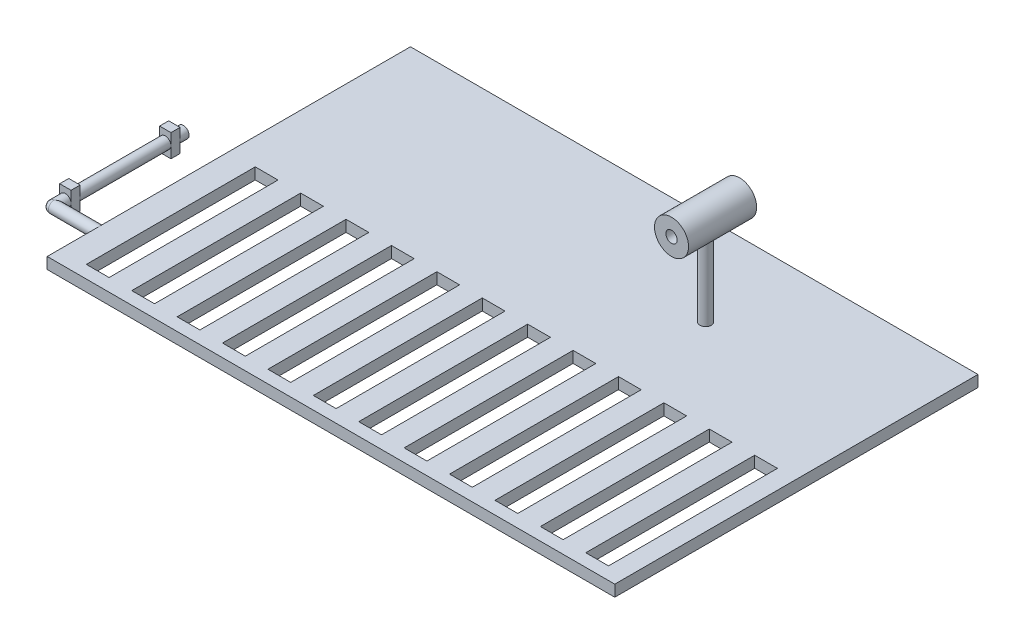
ISO-10303-21;
HEADER;
FILE_DESCRIPTION(('STEP AP214'),'2;1');
FILE_NAME('part.step','',(''),(''),'','','');
FILE_SCHEMA(('AUTOMOTIVE_DESIGN { 1 0 10303 214 1 1 1 1 }'));
ENDSEC;
DATA;
#1=APPLICATION_CONTEXT('core data for automotive mechanical design processes');
#2=APPLICATION_PROTOCOL_DEFINITION('international standard','automotive_design',2000,#1);
#3=PRODUCT_CONTEXT('',#1,'mechanical');
#4=PRODUCT('Part','Part','',(#3));
#5=PRODUCT_RELATED_PRODUCT_CATEGORY('part','',(#4));
#6=PRODUCT_DEFINITION_FORMATION('','',#4);
#7=PRODUCT_DEFINITION_CONTEXT('part definition',#1,'design');
#8=PRODUCT_DEFINITION('design','',#6,#7);
#9=PRODUCT_DEFINITION_SHAPE('','',#8);
#10=(LENGTH_UNIT() NAMED_UNIT(*) SI_UNIT(.MILLI.,.METRE.));
#11=(NAMED_UNIT(*) PLANE_ANGLE_UNIT() SI_UNIT($,.RADIAN.));
#12=(NAMED_UNIT(*) SI_UNIT($,.STERADIAN.) SOLID_ANGLE_UNIT());
#13=UNCERTAINTY_MEASURE_WITH_UNIT(LENGTH_MEASURE(1.E-05),#10,'distance_accuracy_value','');
#14=(GEOMETRIC_REPRESENTATION_CONTEXT(3) GLOBAL_UNCERTAINTY_ASSIGNED_CONTEXT((#13)) GLOBAL_UNIT_ASSIGNED_CONTEXT((#10,
#11,#12)) REPRESENTATION_CONTEXT('',''));
#15=CARTESIAN_POINT('',(0.,0.,0.));
#16=DIRECTION('',(0.,0.,1.));
#17=DIRECTION('',(1.,0.,0.));
#18=AXIS2_PLACEMENT_3D('',#15,#16,#17);
#19=CARTESIAN_POINT('',(190.,42.5,-40.));
#20=DIRECTION('',(0.,-1.,0.));
#21=DIRECTION('',(0.,0.,-1.));
#22=AXIS2_PLACEMENT_3D('',#19,#20,#21);
#23=CYLINDRICAL_SURFACE('',#22,2.50000000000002);
#24=CARTESIAN_POINT('',(190.,2.5,-40.));
#25=DIRECTION('',(0.,-1.,0.));
#26=DIRECTION('',(0.,0.,-1.));
#27=AXIS2_PLACEMENT_3D('',#24,#25,#26);
#28=CIRCLE('',#27,2.50000000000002);
#29=CARTESIAN_POINT('',(190.,2.5,-42.5));
#30=VERTEX_POINT('',#29);
#31=EDGE_CURVE('E554',#30,#30,#28,.F.);
#32=ORIENTED_EDGE('',*,*,#31,.T.);
#33=EDGE_LOOP('',(#32));
#34=FACE_BOUND('',#33,.T.);
#35=CARTESIAN_POINT('',(190.,35.,-42.5));
#36=CARTESIAN_POINT('',(189.863591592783,34.9999996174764,-42.5000006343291));
#37=CARTESIAN_POINT('',(189.727187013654,35.0037557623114,-42.488799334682));
#38=CARTESIAN_POINT('',(189.458395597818,35.018369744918,-42.444427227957));
#39=CARTESIAN_POINT('',(189.326009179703,35.0292283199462,-42.4112541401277));
#40=CARTESIAN_POINT('',(189.069168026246,35.0568673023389,-42.3242018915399));
#41=CARTESIAN_POINT('',(188.944700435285,35.0736378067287,-42.2703573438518));
#42=CARTESIAN_POINT('',(188.706562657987,35.1113888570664,-42.1436470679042));
#43=CARTESIAN_POINT('',(188.592894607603,35.1323702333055,-42.0707775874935));
#44=CARTESIAN_POINT('',(188.375645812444,35.1771476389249,-41.9054354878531));
#45=CARTESIAN_POINT('',(188.272490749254,35.2010110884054,-41.8124219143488));
#46=CARTESIAN_POINT('',(188.082918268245,35.248492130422,-41.6105821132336));
#47=CARTESIAN_POINT('',(187.996504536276,35.2721096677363,-41.5017524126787));
#48=CARTESIAN_POINT('',(187.84043764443,35.3171666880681,-41.2675372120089));
#49=CARTESIAN_POINT('',(187.771337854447,35.3385240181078,-41.1417656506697));
#50=CARTESIAN_POINT('',(187.655452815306,35.375617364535,-40.8795597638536));
#51=CARTESIAN_POINT('',(187.608660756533,35.3913550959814,-40.7431287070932));
#52=CARTESIAN_POINT('',(187.540316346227,35.4147174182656,-40.4683169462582));
#53=CARTESIAN_POINT('',(187.517966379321,35.4225976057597,-40.3301569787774));
#54=CARTESIAN_POINT('',(187.496647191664,35.4301085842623,-40.0518406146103));
#55=CARTESIAN_POINT('',(187.497670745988,35.4297419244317,-39.911684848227));
#56=CARTESIAN_POINT('',(187.522450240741,35.4210246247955,-39.6401584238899));
#57=CARTESIAN_POINT('',(187.545165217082,35.4130396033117,-39.5086789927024));
#58=CARTESIAN_POINT('',(187.610984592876,35.3905835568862,-39.2515164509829));
#59=CARTESIAN_POINT('',(187.65409143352,35.3761117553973,-39.1258340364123));
#60=CARTESIAN_POINT('',(187.760152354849,35.3420522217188,-38.8814681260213));
#61=CARTESIAN_POINT('',(187.823414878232,35.3223858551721,-38.7629299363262));
#62=CARTESIAN_POINT('',(187.967777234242,35.2801860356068,-38.5378227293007));
#63=CARTESIAN_POINT('',(188.04888221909,35.2576517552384,-38.4312571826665));
#64=CARTESIAN_POINT('',(188.231626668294,35.2108167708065,-38.227271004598));
#65=CARTESIAN_POINT('',(188.334117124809,35.1864852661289,-38.1306182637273));
#66=CARTESIAN_POINT('',(188.554151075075,35.1398265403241,-37.9556718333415));
#67=CARTESIAN_POINT('',(188.671696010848,35.1174995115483,-37.8773799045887));
#68=CARTESIAN_POINT('',(188.920130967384,35.0770723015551,-37.7407592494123));
#69=CARTESIAN_POINT('',(189.051141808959,35.059016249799,-37.6826362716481));
#70=CARTESIAN_POINT('',(189.321827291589,35.0294858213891,-37.5894920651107));
#71=CARTESIAN_POINT('',(189.461498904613,35.018009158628,-37.5544628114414));
#72=CARTESIAN_POINT('',(189.739040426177,35.003309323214,-37.5098608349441));
#73=CARTESIAN_POINT('',(189.876726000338,34.9997499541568,-37.4992504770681));
#74=CARTESIAN_POINT('',(190.151937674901,35.0002774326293,-37.5008316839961));
#75=CARTESIAN_POINT('',(190.289463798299,35.0043629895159,-37.5130193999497));
#76=CARTESIAN_POINT('',(190.556299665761,35.0194993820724,-37.5590297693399));
#77=CARTESIAN_POINT('',(190.685732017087,35.0303450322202,-37.5922155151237));
#78=CARTESIAN_POINT('',(190.937139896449,35.0577038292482,-37.6784836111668));
#79=CARTESIAN_POINT('',(191.059114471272,35.0742176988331,-37.7315684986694));
#80=CARTESIAN_POINT('',(191.295720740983,35.1117767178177,-37.8576760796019));
#81=CARTESIAN_POINT('',(191.410074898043,35.1329296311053,-37.9311864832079));
#82=CARTESIAN_POINT('',(191.625162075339,35.1773686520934,-38.0954853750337));
#83=CARTESIAN_POINT('',(191.725890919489,35.2006554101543,-38.1862791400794));
#84=CARTESIAN_POINT('',(191.915631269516,35.2480788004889,-38.3874468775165));
#85=CARTESIAN_POINT('',(192.003902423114,35.2722059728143,-38.4985230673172));
#86=CARTESIAN_POINT('',(192.160643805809,35.3175006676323,-38.7344289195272));
#87=CARTESIAN_POINT('',(192.229113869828,35.3386681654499,-38.8592586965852));
#88=CARTESIAN_POINT('',(192.343992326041,35.3754402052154,-39.1191825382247));
#89=CARTESIAN_POINT('',(192.390445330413,35.3910559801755,-39.2542551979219));
#90=CARTESIAN_POINT('',(192.459736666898,35.4147291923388,-39.5309466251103));
#91=CARTESIAN_POINT('',(192.482585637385,35.422790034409,-39.6725624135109));
#92=CARTESIAN_POINT('',(192.503190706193,35.4300535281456,-39.9504927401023));
#93=CARTESIAN_POINT('',(192.502175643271,35.4296899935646,-40.0867058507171));
#94=CARTESIAN_POINT('',(192.478105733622,35.4212182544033,-40.3569126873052));
#95=CARTESIAN_POINT('',(192.455052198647,35.413110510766,-40.4909065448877));
#96=CARTESIAN_POINT('',(192.388429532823,35.3903868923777,-40.7503391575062));
#97=CARTESIAN_POINT('',(192.345258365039,35.3758975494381,-40.8758920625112));
#98=CARTESIAN_POINT('',(192.239948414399,35.3420900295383,-41.1180685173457));
#99=CARTESIAN_POINT('',(192.177805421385,35.3227707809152,-41.23469007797));
#100=CARTESIAN_POINT('',(192.033151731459,35.2804292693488,-41.4612091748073));
#101=CARTESIAN_POINT('',(191.949870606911,35.2572822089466,-41.570591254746));
#102=CARTESIAN_POINT('',(191.766607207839,35.2104160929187,-41.7742245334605));
#103=CARTESIAN_POINT('',(191.666620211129,35.1866968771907,-41.8684714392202));
#104=CARTESIAN_POINT('',(191.448103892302,35.1402492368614,-42.042861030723));
#105=CARTESIAN_POINT('',(191.329003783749,35.1175954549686,-42.1223108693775));
#106=CARTESIAN_POINT('',(191.078393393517,35.0768502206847,-42.2599760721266));
#107=CARTESIAN_POINT('',(190.946886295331,35.0587576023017,-42.3181968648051));
#108=CARTESIAN_POINT('',(190.681234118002,35.0298621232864,-42.4093040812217));
#109=CARTESIAN_POINT('',(190.547469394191,35.0187696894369,-42.4432061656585));
#110=CARTESIAN_POINT('',(190.275801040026,35.0038398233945,-42.4885507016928));
#111=CARTESIAN_POINT('',(190.137898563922,35.0000003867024,-42.4999993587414));
#112=CARTESIAN_POINT('',(190.,35.,-42.5));
#113=B_SPLINE_CURVE_WITH_KNOTS('',3,(#35,#36,#37,#38,#39,#40,#41,#42,#43,#44,#45,#46,#47,#48,
#49,#50,#51,#52,#53,#54,#55,#56,#57,#58,#59,#60,#61,#62,#63,#64,#65,#66,#67,#68,#69,#70,#71,#72,
#73,#74,#75,#76,#77,#78,#79,#80,#81,#82,#83,#84,#85,#86,#87,#88,#89,#90,#91,#92,#93,#94,#95,#96,
#97,#98,#99,#100,#101,#102,#103,#104,#105,#106,#107,#108,#109,#110,#111,#112),.UNSPECIFIED.,.T.,
.F.,(4,2,2,2,2,2,2,2,2,2,2,2,2,2,2,2,2,2,2,2,2,2,2,2,2,2,2,2,2,2,2,2,2,2,2,2,2,2,4),(0.,
0.408717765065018,0.817477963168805,1.2255566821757,1.63371594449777,2.05461710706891,
2.47561083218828,2.90870962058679,3.34167611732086,3.76004814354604,4.17829084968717,
4.57742066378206,4.9765982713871,5.38220427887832,5.78792756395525,6.21483264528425,
6.64177864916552,7.07296014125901,7.50399172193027,7.91633957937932,8.32861782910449,
8.72895394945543,9.12934113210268,9.54025999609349,9.95130452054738,10.3810255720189,
10.8107502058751,11.2396003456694,11.6682571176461,12.0748916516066,12.4815019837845,
12.8803896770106,13.2793659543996,13.6957516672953,14.1122552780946,14.5449915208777,
14.9776170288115,15.3909139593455,15.8040966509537),.UNSPECIFIED.);
#114=CARTESIAN_POINT('',(190.,35.,-42.5));
#115=VERTEX_POINT('',#114);
#116=EDGE_CURVE('E557',#115,#115,#113,.T.);
#117=ORIENTED_EDGE('',*,*,#116,.F.);
#118=EDGE_LOOP('',(#117));
#119=FACE_BOUND('',#118,.T.);
#120=ADVANCED_FACE('F32',(#34,#119),#23,.T.);
#121=CARTESIAN_POINT('',(270.,2.5,80.));
#122=DIRECTION('',(0.,-1.,0.));
#123=DIRECTION('',(0.,0.,-1.));
#124=AXIS2_PLACEMENT_3D('',#121,#122,#123);
#125=PLANE('',#124);
#126=DIRECTION('',(-1.,0.,0.));
#127=VECTOR('',#126,1.);
#128=CARTESIAN_POINT('',(41.6660739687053,2.5,0.));
#129=LINE('',#128,#127);
#130=CARTESIAN_POINT('',(41.6660739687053,2.5,0.));
#131=VERTEX_POINT('',#130);
#132=CARTESIAN_POINT('',(31.6334407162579,2.5,0.));
#133=VERTEX_POINT('',#132);
#134=EDGE_CURVE('E1725',#131,#133,#129,.T.);
#135=ORIENTED_EDGE('',*,*,#134,.F.);
#136=DIRECTION('',(0.,0.,-1.));
#137=VECTOR('',#136,1.);
#138=CARTESIAN_POINT('',(41.6660739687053,2.5,0.));
#139=LINE('',#138,#137);
#140=CARTESIAN_POINT('',(41.6660739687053,2.5,74.4086966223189));
#141=VERTEX_POINT('',#140);
#142=EDGE_CURVE('E47',#141,#131,#139,.T.);
#143=ORIENTED_EDGE('',*,*,#142,.F.);
#144=DIRECTION('',(1.,0.,0.));
#145=VECTOR('',#144,1.);
#146=CARTESIAN_POINT('',(41.6660739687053,2.5,74.4086966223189));
#147=LINE('',#146,#145);
#148=CARTESIAN_POINT('',(31.6334407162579,2.5,74.4086966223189));
#149=VERTEX_POINT('',#148);
#150=EDGE_CURVE('E1715',#149,#141,#147,.T.);
#151=ORIENTED_EDGE('',*,*,#150,.F.);
#152=DIRECTION('',(0.,0.,1.));
#153=VECTOR('',#152,1.);
#154=CARTESIAN_POINT('',(31.6334407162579,2.5,0.));
#155=LINE('',#154,#153);
#156=EDGE_CURVE('E1722',#133,#149,#155,.T.);
#157=ORIENTED_EDGE('',*,*,#156,.F.);
#158=EDGE_LOOP('',(#135,#143,#151,#157));
#159=FACE_BOUND('',#158,.T.);
#160=DIRECTION('',(-1.,0.,0.));
#161=VECTOR('',#160,1.);
#162=CARTESIAN_POINT('',(61.6660739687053,2.5,0.));
#163=LINE('',#162,#161);
#164=CARTESIAN_POINT('',(61.6660739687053,2.5,0.));
#165=VERTEX_POINT('',#164);
#166=CARTESIAN_POINT('',(51.6334407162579,2.5,0.));
#167=VERTEX_POINT('',#166);
#168=EDGE_CURVE('E1707',#165,#167,#163,.T.);
#169=ORIENTED_EDGE('',*,*,#168,.F.);
#170=DIRECTION('',(0.,0.,-1.));
#171=VECTOR('',#170,1.);
#172=CARTESIAN_POINT('',(61.6660739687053,2.5,0.));
#173=LINE('',#172,#171);
#174=CARTESIAN_POINT('',(61.6660739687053,2.5,74.4086966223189));
#175=VERTEX_POINT('',#174);
#176=EDGE_CURVE('E1710',#175,#165,#173,.T.);
#177=ORIENTED_EDGE('',*,*,#176,.F.);
#178=DIRECTION('',(1.,0.,0.));
#179=VECTOR('',#178,1.);
#180=CARTESIAN_POINT('',(61.6660739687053,2.5,74.4086966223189));
#181=LINE('',#180,#179);
#182=CARTESIAN_POINT('',(51.6334407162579,2.5,74.4086966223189));
#183=VERTEX_POINT('',#182);
#184=EDGE_CURVE('E1697',#183,#175,#181,.T.);
#185=ORIENTED_EDGE('',*,*,#184,.F.);
#186=DIRECTION('',(0.,0.,1.));
#187=VECTOR('',#186,1.);
#188=CARTESIAN_POINT('',(51.6334407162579,2.5,0.));
#189=LINE('',#188,#187);
#190=EDGE_CURVE('E1704',#167,#183,#189,.T.);
#191=ORIENTED_EDGE('',*,*,#190,.F.);
#192=EDGE_LOOP('',(#169,#177,#185,#191));
#193=FACE_BOUND('',#192,.T.);
#194=DIRECTION('',(-1.,0.,0.));
#195=VECTOR('',#194,1.);
#196=CARTESIAN_POINT('',(81.6660739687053,2.5,0.));
#197=LINE('',#196,#195);
#198=CARTESIAN_POINT('',(81.6660739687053,2.5,0.));
#199=VERTEX_POINT('',#198);
#200=CARTESIAN_POINT('',(71.6334407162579,2.5,0.));
#201=VERTEX_POINT('',#200);
#202=EDGE_CURVE('E1687',#199,#201,#197,.T.);
#203=ORIENTED_EDGE('',*,*,#202,.F.);
#204=DIRECTION('',(0.,0.,-1.));
#205=VECTOR('',#204,1.);
#206=CARTESIAN_POINT('',(81.6660739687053,2.5,0.));
#207=LINE('',#206,#205);
#208=CARTESIAN_POINT('',(81.6660739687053,2.5,74.4086966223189));
#209=VERTEX_POINT('',#208);
#210=EDGE_CURVE('E1690',#209,#199,#207,.T.);
#211=ORIENTED_EDGE('',*,*,#210,.F.);
#212=DIRECTION('',(1.,0.,0.));
#213=VECTOR('',#212,1.);
#214=CARTESIAN_POINT('',(81.6660739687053,2.5,74.4086966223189));
#215=LINE('',#214,#213);
#216=CARTESIAN_POINT('',(71.6334407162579,2.5,74.4086966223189));
#217=VERTEX_POINT('',#216);
#218=EDGE_CURVE('E1677',#217,#209,#215,.T.);
#219=ORIENTED_EDGE('',*,*,#218,.F.);
#220=DIRECTION('',(0.,0.,1.));
#221=VECTOR('',#220,1.);
#222=CARTESIAN_POINT('',(71.6334407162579,2.5,0.));
#223=LINE('',#222,#221);
#224=EDGE_CURVE('E1684',#201,#217,#223,.T.);
#225=ORIENTED_EDGE('',*,*,#224,.F.);
#226=EDGE_LOOP('',(#203,#211,#219,#225));
#227=FACE_BOUND('',#226,.T.);
#228=DIRECTION('',(-1.,0.,0.));
#229=VECTOR('',#228,1.);
#230=CARTESIAN_POINT('',(101.666073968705,2.5,0.));
#231=LINE('',#230,#229);
#232=CARTESIAN_POINT('',(101.666073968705,2.5,0.));
#233=VERTEX_POINT('',#232);
#234=CARTESIAN_POINT('',(91.6334407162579,2.5,0.));
#235=VERTEX_POINT('',#234);
#236=EDGE_CURVE('E1667',#233,#235,#231,.T.);
#237=ORIENTED_EDGE('',*,*,#236,.F.);
#238=DIRECTION('',(0.,0.,-1.));
#239=VECTOR('',#238,1.);
#240=CARTESIAN_POINT('',(101.666073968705,2.5,0.));
#241=LINE('',#240,#239);
#242=CARTESIAN_POINT('',(101.666073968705,2.5,74.4086966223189));
#243=VERTEX_POINT('',#242);
#244=EDGE_CURVE('E1670',#243,#233,#241,.T.);
#245=ORIENTED_EDGE('',*,*,#244,.F.);
#246=DIRECTION('',(1.,0.,0.));
#247=VECTOR('',#246,1.);
#248=CARTESIAN_POINT('',(101.666073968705,2.5,74.4086966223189));
#249=LINE('',#248,#247);
#250=CARTESIAN_POINT('',(91.6334407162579,2.5,74.4086966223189));
#251=VERTEX_POINT('',#250);
#252=EDGE_CURVE('E1657',#251,#243,#249,.T.);
#253=ORIENTED_EDGE('',*,*,#252,.F.);
#254=DIRECTION('',(0.,0.,1.));
#255=VECTOR('',#254,1.);
#256=CARTESIAN_POINT('',(91.6334407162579,2.5,0.));
#257=LINE('',#256,#255);
#258=EDGE_CURVE('E1664',#235,#251,#257,.T.);
#259=ORIENTED_EDGE('',*,*,#258,.F.);
#260=EDGE_LOOP('',(#237,#245,#253,#259));
#261=FACE_BOUND('',#260,.T.);
#262=DIRECTION('',(-1.,0.,0.));
#263=VECTOR('',#262,1.);
#264=CARTESIAN_POINT('',(121.666073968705,2.5,0.));
#265=LINE('',#264,#263);
#266=CARTESIAN_POINT('',(121.666073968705,2.5,0.));
#267=VERTEX_POINT('',#266);
#268=CARTESIAN_POINT('',(111.633440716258,2.5,0.));
#269=VERTEX_POINT('',#268);
#270=EDGE_CURVE('E1647',#267,#269,#265,.T.);
#271=ORIENTED_EDGE('',*,*,#270,.F.);
#272=DIRECTION('',(0.,0.,-1.));
#273=VECTOR('',#272,1.);
#274=CARTESIAN_POINT('',(121.666073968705,2.5,0.));
#275=LINE('',#274,#273);
#276=CARTESIAN_POINT('',(121.666073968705,2.5,74.4086966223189));
#277=VERTEX_POINT('',#276);
#278=EDGE_CURVE('E1650',#277,#267,#275,.T.);
#279=ORIENTED_EDGE('',*,*,#278,.F.);
#280=DIRECTION('',(1.,0.,0.));
#281=VECTOR('',#280,1.);
#282=CARTESIAN_POINT('',(121.666073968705,2.5,74.4086966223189));
#283=LINE('',#282,#281);
#284=CARTESIAN_POINT('',(111.633440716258,2.5,74.4086966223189));
#285=VERTEX_POINT('',#284);
#286=EDGE_CURVE('E1637',#285,#277,#283,.T.);
#287=ORIENTED_EDGE('',*,*,#286,.F.);
#288=DIRECTION('',(0.,0.,1.));
#289=VECTOR('',#288,1.);
#290=CARTESIAN_POINT('',(111.633440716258,2.5,0.));
#291=LINE('',#290,#289);
#292=EDGE_CURVE('E1644',#269,#285,#291,.T.);
#293=ORIENTED_EDGE('',*,*,#292,.F.);
#294=EDGE_LOOP('',(#271,#279,#287,#293));
#295=FACE_BOUND('',#294,.T.);
#296=DIRECTION('',(-1.,0.,0.));
#297=VECTOR('',#296,1.);
#298=CARTESIAN_POINT('',(141.666073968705,2.5,0.));
#299=LINE('',#298,#297);
#300=CARTESIAN_POINT('',(141.666073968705,2.5,0.));
#301=VERTEX_POINT('',#300);
#302=CARTESIAN_POINT('',(131.633440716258,2.5,0.));
#303=VERTEX_POINT('',#302);
#304=EDGE_CURVE('E1627',#301,#303,#299,.T.);
#305=ORIENTED_EDGE('',*,*,#304,.F.);
#306=DIRECTION('',(0.,0.,-1.));
#307=VECTOR('',#306,1.);
#308=CARTESIAN_POINT('',(141.666073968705,2.5,0.));
#309=LINE('',#308,#307);
#310=CARTESIAN_POINT('',(141.666073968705,2.5,74.4086966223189));
#311=VERTEX_POINT('',#310);
#312=EDGE_CURVE('E1630',#311,#301,#309,.T.);
#313=ORIENTED_EDGE('',*,*,#312,.F.);
#314=DIRECTION('',(1.,0.,0.));
#315=VECTOR('',#314,1.);
#316=CARTESIAN_POINT('',(141.666073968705,2.5,74.4086966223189));
#317=LINE('',#316,#315);
#318=CARTESIAN_POINT('',(131.633440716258,2.5,74.4086966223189));
#319=VERTEX_POINT('',#318);
#320=EDGE_CURVE('E1617',#319,#311,#317,.T.);
#321=ORIENTED_EDGE('',*,*,#320,.F.);
#322=DIRECTION('',(0.,0.,1.));
#323=VECTOR('',#322,1.);
#324=CARTESIAN_POINT('',(131.633440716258,2.5,0.));
#325=LINE('',#324,#323);
#326=EDGE_CURVE('E1624',#303,#319,#325,.T.);
#327=ORIENTED_EDGE('',*,*,#326,.F.);
#328=EDGE_LOOP('',(#305,#313,#321,#327));
#329=FACE_BOUND('',#328,.T.);
#330=DIRECTION('',(-1.,0.,0.));
#331=VECTOR('',#330,1.);
#332=CARTESIAN_POINT('',(161.666073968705,2.5,0.));
#333=LINE('',#332,#331);
#334=CARTESIAN_POINT('',(161.666073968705,2.5,0.));
#335=VERTEX_POINT('',#334);
#336=CARTESIAN_POINT('',(151.633440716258,2.5,0.));
#337=VERTEX_POINT('',#336);
#338=EDGE_CURVE('E1607',#335,#337,#333,.T.);
#339=ORIENTED_EDGE('',*,*,#338,.F.);
#340=DIRECTION('',(0.,0.,-1.));
#341=VECTOR('',#340,1.);
#342=CARTESIAN_POINT('',(161.666073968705,2.5,0.));
#343=LINE('',#342,#341);
#344=CARTESIAN_POINT('',(161.666073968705,2.5,74.4086966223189));
#345=VERTEX_POINT('',#344);
#346=EDGE_CURVE('E1610',#345,#335,#343,.T.);
#347=ORIENTED_EDGE('',*,*,#346,.F.);
#348=DIRECTION('',(1.,0.,0.));
#349=VECTOR('',#348,1.);
#350=CARTESIAN_POINT('',(161.666073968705,2.5,74.4086966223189));
#351=LINE('',#350,#349);
#352=CARTESIAN_POINT('',(151.633440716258,2.5,74.4086966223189));
#353=VERTEX_POINT('',#352);
#354=EDGE_CURVE('E1597',#353,#345,#351,.T.);
#355=ORIENTED_EDGE('',*,*,#354,.F.);
#356=DIRECTION('',(0.,0.,1.));
#357=VECTOR('',#356,1.);
#358=CARTESIAN_POINT('',(151.633440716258,2.5,0.));
#359=LINE('',#358,#357);
#360=EDGE_CURVE('E1604',#337,#353,#359,.T.);
#361=ORIENTED_EDGE('',*,*,#360,.F.);
#362=EDGE_LOOP('',(#339,#347,#355,#361));
#363=FACE_BOUND('',#362,.T.);
#364=DIRECTION('',(-1.,0.,0.));
#365=VECTOR('',#364,1.);
#366=CARTESIAN_POINT('',(181.666073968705,2.5,0.));
#367=LINE('',#366,#365);
#368=CARTESIAN_POINT('',(181.666073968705,2.5,0.));
#369=VERTEX_POINT('',#368);
#370=CARTESIAN_POINT('',(171.633440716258,2.5,0.));
#371=VERTEX_POINT('',#370);
#372=EDGE_CURVE('E1587',#369,#371,#367,.T.);
#373=ORIENTED_EDGE('',*,*,#372,.F.);
#374=DIRECTION('',(0.,0.,-1.));
#375=VECTOR('',#374,1.);
#376=CARTESIAN_POINT('',(181.666073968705,2.5,0.));
#377=LINE('',#376,#375);
#378=CARTESIAN_POINT('',(181.666073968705,2.5,74.4086966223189));
#379=VERTEX_POINT('',#378);
#380=EDGE_CURVE('E1590',#379,#369,#377,.T.);
#381=ORIENTED_EDGE('',*,*,#380,.F.);
#382=DIRECTION('',(1.,0.,0.));
#383=VECTOR('',#382,1.);
#384=CARTESIAN_POINT('',(181.666073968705,2.5,74.4086966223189));
#385=LINE('',#384,#383);
#386=CARTESIAN_POINT('',(171.633440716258,2.5,74.4086966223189));
#387=VERTEX_POINT('',#386);
#388=EDGE_CURVE('E1577',#387,#379,#385,.T.);
#389=ORIENTED_EDGE('',*,*,#388,.F.);
#390=DIRECTION('',(0.,0.,1.));
#391=VECTOR('',#390,1.);
#392=CARTESIAN_POINT('',(171.633440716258,2.5,0.));
#393=LINE('',#392,#391);
#394=EDGE_CURVE('E1584',#371,#387,#393,.T.);
#395=ORIENTED_EDGE('',*,*,#394,.F.);
#396=EDGE_LOOP('',(#373,#381,#389,#395));
#397=FACE_BOUND('',#396,.T.);
#398=DIRECTION('',(-1.,0.,0.));
#399=VECTOR('',#398,1.);
#400=CARTESIAN_POINT('',(201.666073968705,2.5,0.));
#401=LINE('',#400,#399);
#402=CARTESIAN_POINT('',(201.666073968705,2.5,0.));
#403=VERTEX_POINT('',#402);
#404=CARTESIAN_POINT('',(191.633440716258,2.5,0.));
#405=VERTEX_POINT('',#404);
#406=EDGE_CURVE('E1567',#403,#405,#401,.T.);
#407=ORIENTED_EDGE('',*,*,#406,.F.);
#408=DIRECTION('',(0.,0.,-1.));
#409=VECTOR('',#408,1.);
#410=CARTESIAN_POINT('',(201.666073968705,2.5,0.));
#411=LINE('',#410,#409);
#412=CARTESIAN_POINT('',(201.666073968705,2.5,74.4086966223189));
#413=VERTEX_POINT('',#412);
#414=EDGE_CURVE('E1570',#413,#403,#411,.T.);
#415=ORIENTED_EDGE('',*,*,#414,.F.);
#416=DIRECTION('',(1.,0.,0.));
#417=VECTOR('',#416,1.);
#418=CARTESIAN_POINT('',(201.666073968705,2.5,74.4086966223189));
#419=LINE('',#418,#417);
#420=CARTESIAN_POINT('',(191.633440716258,2.5,74.4086966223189));
#421=VERTEX_POINT('',#420);
#422=EDGE_CURVE('E1557',#421,#413,#419,.T.);
#423=ORIENTED_EDGE('',*,*,#422,.F.);
#424=DIRECTION('',(0.,0.,1.));
#425=VECTOR('',#424,1.);
#426=CARTESIAN_POINT('',(191.633440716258,2.5,0.));
#427=LINE('',#426,#425);
#428=EDGE_CURVE('E1564',#405,#421,#427,.T.);
#429=ORIENTED_EDGE('',*,*,#428,.F.);
#430=EDGE_LOOP('',(#407,#415,#423,#429));
#431=FACE_BOUND('',#430,.T.);
#432=DIRECTION('',(-1.,0.,0.));
#433=VECTOR('',#432,1.);
#434=CARTESIAN_POINT('',(221.666073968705,2.5,0.));
#435=LINE('',#434,#433);
#436=CARTESIAN_POINT('',(221.666073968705,2.5,0.));
#437=VERTEX_POINT('',#436);
#438=CARTESIAN_POINT('',(211.633440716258,2.5,0.));
#439=VERTEX_POINT('',#438);
#440=EDGE_CURVE('E1547',#437,#439,#435,.T.);
#441=ORIENTED_EDGE('',*,*,#440,.F.);
#442=DIRECTION('',(0.,0.,-1.));
#443=VECTOR('',#442,1.);
#444=CARTESIAN_POINT('',(221.666073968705,2.5,0.));
#445=LINE('',#444,#443);
#446=CARTESIAN_POINT('',(221.666073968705,2.5,74.4086966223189));
#447=VERTEX_POINT('',#446);
#448=EDGE_CURVE('E1550',#447,#437,#445,.T.);
#449=ORIENTED_EDGE('',*,*,#448,.F.);
#450=DIRECTION('',(1.,0.,0.));
#451=VECTOR('',#450,1.);
#452=CARTESIAN_POINT('',(221.666073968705,2.5,74.4086966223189));
#453=LINE('',#452,#451);
#454=CARTESIAN_POINT('',(211.633440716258,2.5,74.4086966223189));
#455=VERTEX_POINT('',#454);
#456=EDGE_CURVE('E1537',#455,#447,#453,.T.);
#457=ORIENTED_EDGE('',*,*,#456,.F.);
#458=DIRECTION('',(0.,0.,1.));
#459=VECTOR('',#458,1.);
#460=CARTESIAN_POINT('',(211.633440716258,2.5,0.));
#461=LINE('',#460,#459);
#462=EDGE_CURVE('E1544',#439,#455,#461,.T.);
#463=ORIENTED_EDGE('',*,*,#462,.F.);
#464=EDGE_LOOP('',(#441,#449,#457,#463));
#465=FACE_BOUND('',#464,.T.);
#466=DIRECTION('',(-1.,0.,0.));
#467=VECTOR('',#466,1.);
#468=CARTESIAN_POINT('',(241.666073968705,2.5,0.));
#469=LINE('',#468,#467);
#470=CARTESIAN_POINT('',(241.666073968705,2.5,0.));
#471=VERTEX_POINT('',#470);
#472=CARTESIAN_POINT('',(231.633440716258,2.5,0.));
#473=VERTEX_POINT('',#472);
#474=EDGE_CURVE('E1527',#471,#473,#469,.T.);
#475=ORIENTED_EDGE('',*,*,#474,.F.);
#476=DIRECTION('',(0.,0.,-1.));
#477=VECTOR('',#476,1.);
#478=CARTESIAN_POINT('',(241.666073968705,2.5,0.));
#479=LINE('',#478,#477);
#480=CARTESIAN_POINT('',(241.666073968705,2.5,74.4086966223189));
#481=VERTEX_POINT('',#480);
#482=EDGE_CURVE('E1530',#481,#471,#479,.T.);
#483=ORIENTED_EDGE('',*,*,#482,.F.);
#484=DIRECTION('',(1.,0.,0.));
#485=VECTOR('',#484,1.);
#486=CARTESIAN_POINT('',(241.666073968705,2.5,74.4086966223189));
#487=LINE('',#486,#485);
#488=CARTESIAN_POINT('',(231.633440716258,2.5,74.4086966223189));
#489=VERTEX_POINT('',#488);
#490=EDGE_CURVE('E1517',#489,#481,#487,.T.);
#491=ORIENTED_EDGE('',*,*,#490,.F.);
#492=DIRECTION('',(0.,0.,1.));
#493=VECTOR('',#492,1.);
#494=CARTESIAN_POINT('',(231.633440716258,2.5,0.));
#495=LINE('',#494,#493);
#496=EDGE_CURVE('E1524',#473,#489,#495,.T.);
#497=ORIENTED_EDGE('',*,*,#496,.F.);
#498=EDGE_LOOP('',(#475,#483,#491,#497));
#499=FACE_BOUND('',#498,.T.);
#500=DIRECTION('',(-1.,0.,0.));
#501=VECTOR('',#500,1.);
#502=CARTESIAN_POINT('',(261.666073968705,2.5,0.));
#503=LINE('',#502,#501);
#504=CARTESIAN_POINT('',(261.666073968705,2.5,0.));
#505=VERTEX_POINT('',#504);
#506=CARTESIAN_POINT('',(251.633440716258,2.5,0.));
#507=VERTEX_POINT('',#506);
#508=EDGE_CURVE('E1507',#505,#507,#503,.T.);
#509=ORIENTED_EDGE('',*,*,#508,.F.);
#510=DIRECTION('',(0.,0.,-1.));
#511=VECTOR('',#510,1.);
#512=CARTESIAN_POINT('',(261.666073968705,2.5,0.));
#513=LINE('',#512,#511);
#514=CARTESIAN_POINT('',(261.666073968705,2.5,74.4086966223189));
#515=VERTEX_POINT('',#514);
#516=EDGE_CURVE('E1510',#515,#505,#513,.T.);
#517=ORIENTED_EDGE('',*,*,#516,.F.);
#518=DIRECTION('',(1.,0.,0.));
#519=VECTOR('',#518,1.);
#520=CARTESIAN_POINT('',(261.666073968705,2.5,74.4086966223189));
#521=LINE('',#520,#519);
#522=CARTESIAN_POINT('',(251.633440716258,2.5,74.4086966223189));
#523=VERTEX_POINT('',#522);
#524=EDGE_CURVE('E1497',#523,#515,#521,.T.);
#525=ORIENTED_EDGE('',*,*,#524,.F.);
#526=DIRECTION('',(0.,0.,1.));
#527=VECTOR('',#526,1.);
#528=CARTESIAN_POINT('',(251.633440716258,2.5,0.));
#529=LINE('',#528,#527);
#530=EDGE_CURVE('E1504',#507,#523,#529,.T.);
#531=ORIENTED_EDGE('',*,*,#530,.F.);
#532=EDGE_LOOP('',(#509,#517,#525,#531));
#533=FACE_BOUND('',#532,.T.);
#534=DIRECTION('',(0.,0.,1.));
#535=VECTOR('',#534,1.);
#536=CARTESIAN_POINT('',(20.,2.5,80.));
#537=LINE('',#536,#535);
#538=CARTESIAN_POINT('',(20.,2.5,-80.));
#539=VERTEX_POINT('',#538);
#540=CARTESIAN_POINT('',(20.,2.5,57.));
#541=VERTEX_POINT('',#540);
#542=EDGE_CURVE('E1439',#539,#541,#537,.T.);
#543=ORIENTED_EDGE('',*,*,#542,.T.);
#544=CARTESIAN_POINT('',(20.,2.5,80.));
#545=VERTEX_POINT('',#544);
#546=EDGE_CURVE('E1462',#541,#545,#537,.T.);
#547=ORIENTED_EDGE('',*,*,#546,.T.);
#548=DIRECTION('',(-1.,0.,0.));
#549=VECTOR('',#548,1.);
#550=CARTESIAN_POINT('',(270.,2.5,80.));
#551=LINE('',#550,#549);
#552=CARTESIAN_POINT('',(270.,2.5,80.));
#553=VERTEX_POINT('',#552);
#554=EDGE_CURVE('E1475',#553,#545,#551,.T.);
#555=ORIENTED_EDGE('',*,*,#554,.F.);
#556=DIRECTION('',(0.,0.,1.));
#557=VECTOR('',#556,1.);
#558=CARTESIAN_POINT('',(270.,2.5,80.));
#559=LINE('',#558,#557);
#560=CARTESIAN_POINT('',(270.,2.5,-80.));
#561=VERTEX_POINT('',#560);
#562=EDGE_CURVE('E1436',#561,#553,#559,.T.);
#563=ORIENTED_EDGE('',*,*,#562,.F.);
#564=DIRECTION('',(-1.,0.,0.));
#565=VECTOR('',#564,1.);
#566=CARTESIAN_POINT('',(270.,2.5,-80.));
#567=LINE('',#566,#565);
#568=EDGE_CURVE('E1450',#561,#539,#567,.T.);
#569=ORIENTED_EDGE('',*,*,#568,.T.);
#570=EDGE_LOOP('',(#543,#547,#555,#563,#569));
#571=FACE_BOUND('',#570,.T.);
#572=ORIENTED_EDGE('',*,*,#31,.F.);
#573=EDGE_LOOP('',(#572));
#574=FACE_BOUND('',#573,.T.);
#575=ADVANCED_FACE('F780',(#159,#193,#227,#261,#295,#329,#363,#397,#431,#465,#499,#533,#571,
#574),#125,.F.);
#576=CARTESIAN_POINT('',(0.,0.,57.));
#577=DIRECTION('',(0.,0.,-1.));
#578=DIRECTION('',(-1.,0.,0.));
#579=AXIS2_PLACEMENT_3D('',#576,#577,#578);
#580=CYLINDRICAL_SURFACE('',#579,2.5);
#581=CARTESIAN_POINT('',(0.,0.,52.));
#582=DIRECTION('',(0.,0.,1.));
#583=DIRECTION('',(1.,0.,0.));
#584=AXIS2_PLACEMENT_3D('',#581,#582,#583);
#585=CIRCLE('',#584,2.5);
#586=CARTESIAN_POINT('',(2.5,0.,52.));
#587=VERTEX_POINT('',#586);
#588=CARTESIAN_POINT('',(-2.5,0.,52.));
#589=VERTEX_POINT('',#588);
#590=EDGE_CURVE('E458',#587,#589,#585,.T.);
#591=ORIENTED_EDGE('',*,*,#590,.T.);
#592=EDGE_CURVE('E468',#589,#587,#585,.T.);
#593=ORIENTED_EDGE('',*,*,#592,.T.);
#594=EDGE_LOOP('',(#591,#593));
#595=FACE_BOUND('',#594,.T.);
#596=CARTESIAN_POINT('',(0.,0.,57.));
#597=DIRECTION('',(-0.707106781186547,0.,-0.707106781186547));
#598=DIRECTION('',(0.707106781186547,0.,-0.707106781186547));
#599=AXIS2_PLACEMENT_3D('',#596,#597,#598);
#600=ELLIPSE('',#599,3.53553390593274,2.5);
#601=CARTESIAN_POINT('',(0.,-2.5,57.));
#602=VERTEX_POINT('',#601);
#603=CARTESIAN_POINT('',(0.,2.5,57.));
#604=VERTEX_POINT('',#603);
#605=EDGE_CURVE('E455',#602,#604,#600,.F.);
#606=ORIENTED_EDGE('',*,*,#605,.F.);
#607=CARTESIAN_POINT('',(0.,0.,57.));
#608=DIRECTION('',(0.,0.,1.));
#609=DIRECTION('',(1.,0.,0.));
#610=AXIS2_PLACEMENT_3D('',#607,#608,#609);
#611=CIRCLE('',#610,2.5);
#612=EDGE_CURVE('E449',#604,#602,#611,.T.);
#613=ORIENTED_EDGE('',*,*,#612,.F.);
#614=EDGE_LOOP('',(#606,#613));
#615=FACE_BOUND('',#614,.T.);
#616=ADVANCED_FACE('F461',(#595,#615),#580,.T.);
#617=CARTESIAN_POINT('',(2.5,5.,52.));
#618=DIRECTION('',(0.,0.,1.));
#619=DIRECTION('',(1.,0.,0.));
#620=AXIS2_PLACEMENT_3D('',#617,#618,#619);
#621=PLANE('',#620);
#622=ORIENTED_EDGE('',*,*,#590,.F.);
#623=DIRECTION('',(0.,1.,0.));
#624=VECTOR('',#623,1.);
#625=CARTESIAN_POINT('',(2.5,-5.,52.));
#626=LINE('',#625,#624);
#627=CARTESIAN_POINT('',(2.5,5.,52.));
#628=VERTEX_POINT('',#627);
#629=EDGE_CURVE('E481',#587,#628,#626,.T.);
#630=ORIENTED_EDGE('',*,*,#629,.T.);
#631=DIRECTION('',(-1.,0.,0.));
#632=VECTOR('',#631,1.);
#633=CARTESIAN_POINT('',(2.5,5.,52.));
#634=LINE('',#633,#632);
#635=CARTESIAN_POINT('',(-2.5,5.,52.));
#636=VERTEX_POINT('',#635);
#637=EDGE_CURVE('E484',#628,#636,#634,.T.);
#638=ORIENTED_EDGE('',*,*,#637,.T.);
#639=DIRECTION('',(0.,-1.,0.));
#640=VECTOR('',#639,1.);
#641=CARTESIAN_POINT('',(-2.5,5.,52.));
#642=LINE('',#641,#640);
#643=EDGE_CURVE('E487',#636,#589,#642,.T.);
#644=ORIENTED_EDGE('',*,*,#643,.T.);
#645=EDGE_LOOP('',(#622,#630,#638,#644));
#646=FACE_BOUND('',#645,.T.);
#647=ADVANCED_FACE('F795',(#646),#621,.T.);
#648=CARTESIAN_POINT('',(-2.5,-5.,8.));
#649=DIRECTION('',(0.,0.,1.));
#650=DIRECTION('',(1.,0.,0.));
#651=AXIS2_PLACEMENT_3D('',#648,#649,#650);
#652=PLANE('',#651);
#653=CARTESIAN_POINT('',(0.,0.,8.));
#654=DIRECTION('',(0.,0.,1.));
#655=DIRECTION('',(1.,0.,0.));
#656=AXIS2_PLACEMENT_3D('',#653,#654,#655);
#657=CIRCLE('',#656,2.5);
#658=CARTESIAN_POINT('',(2.5,0.,8.));
#659=VERTEX_POINT('',#658);
#660=CARTESIAN_POINT('',(-2.5,0.,8.));
#661=VERTEX_POINT('',#660);
#662=EDGE_CURVE('E504',#659,#661,#657,.T.);
#663=ORIENTED_EDGE('',*,*,#662,.F.);
#664=DIRECTION('',(0.,1.,0.));
#665=VECTOR('',#664,1.);
#666=CARTESIAN_POINT('',(2.5,5.,8.));
#667=LINE('',#666,#665);
#668=CARTESIAN_POINT('',(2.5,5.,8.));
#669=VERTEX_POINT('',#668);
#670=EDGE_CURVE('E530',#659,#669,#667,.T.);
#671=ORIENTED_EDGE('',*,*,#670,.T.);
#672=DIRECTION('',(-1.,0.,0.));
#673=VECTOR('',#672,1.);
#674=CARTESIAN_POINT('',(-2.5,5.,8.));
#675=LINE('',#674,#673);
#676=CARTESIAN_POINT('',(-2.5,5.,8.));
#677=VERTEX_POINT('',#676);
#678=EDGE_CURVE('E533',#669,#677,#675,.T.);
#679=ORIENTED_EDGE('',*,*,#678,.T.);
#680=DIRECTION('',(0.,-1.,0.));
#681=VECTOR('',#680,1.);
#682=CARTESIAN_POINT('',(-2.5,5.,8.));
#683=LINE('',#682,#681);
#684=EDGE_CURVE('E525',#677,#661,#683,.T.);
#685=ORIENTED_EDGE('',*,*,#684,.T.);
#686=EDGE_LOOP('',(#663,#671,#679,#685));
#687=FACE_BOUND('',#686,.T.);
#688=ADVANCED_FACE('F859',(#687),#652,.T.);
#689=CARTESIAN_POINT('',(0.,0.,4.));
#690=DIRECTION('',(0.,0.,-1.));
#691=DIRECTION('',(-1.,0.,0.));
#692=AXIS2_PLACEMENT_3D('',#689,#690,#691);
#693=CYLINDRICAL_SURFACE('',#692,2.5);
#694=CARTESIAN_POINT('',(0.,0.,4.));
#695=DIRECTION('',(0.,0.,1.));
#696=DIRECTION('',(1.,0.,0.));
#697=AXIS2_PLACEMENT_3D('',#694,#695,#696);
#698=CIRCLE('',#697,2.5);
#699=CARTESIAN_POINT('',(2.5,0.,4.));
#700=VERTEX_POINT('',#699);
#701=CARTESIAN_POINT('',(-2.5,0.,4.));
#702=VERTEX_POINT('',#701);
#703=EDGE_CURVE('E551',#700,#702,#698,.T.);
#704=ORIENTED_EDGE('',*,*,#703,.F.);
#705=EDGE_CURVE('E550',#702,#700,#698,.T.);
#706=ORIENTED_EDGE('',*,*,#705,.F.);
#707=EDGE_LOOP('',(#704,#706));
#708=FACE_BOUND('',#707,.T.);
#709=CARTESIAN_POINT('',(0.,0.,0.));
#710=DIRECTION('',(0.,0.,1.));
#711=DIRECTION('',(1.,0.,0.));
#712=AXIS2_PLACEMENT_3D('',#709,#710,#711);
#713=CIRCLE('',#712,2.5);
#714=CARTESIAN_POINT('',(2.5,0.,0.));
#715=VERTEX_POINT('',#714);
#716=EDGE_CURVE('E547',#715,#715,#713,.T.);
#717=ORIENTED_EDGE('',*,*,#716,.T.);
#718=EDGE_LOOP('',(#717));
#719=FACE_BOUND('',#718,.T.);
#720=ADVANCED_FACE('F34',(#708,#719),#693,.T.);
#721=CARTESIAN_POINT('',(0.,0.,0.));
#722=DIRECTION('',(0.,0.,1.));
#723=DIRECTION('',(1.,0.,0.));
#724=AXIS2_PLACEMENT_3D('',#721,#722,#723);
#725=PLANE('',#724);
#726=ORIENTED_EDGE('',*,*,#716,.F.);
#727=EDGE_LOOP('',(#726));
#728=FACE_BOUND('',#727,.T.);
#729=ADVANCED_FACE('F853',(#728),#725,.F.);
#730=CARTESIAN_POINT('',(-2.5,-5.,4.));
#731=DIRECTION('',(0.,0.,1.));
#732=DIRECTION('',(1.,0.,0.));
#733=AXIS2_PLACEMENT_3D('',#730,#731,#732);
#734=PLANE('',#733);
#735=DIRECTION('',(0.,1.,0.));
#736=VECTOR('',#735,1.);
#737=CARTESIAN_POINT('',(2.5,5.,4.));
#738=LINE('',#737,#736);
#739=CARTESIAN_POINT('',(2.5,5.,4.));
#740=VERTEX_POINT('',#739);
#741=EDGE_CURVE('E518',#700,#740,#738,.T.);
#742=ORIENTED_EDGE('',*,*,#741,.F.);
#743=ORIENTED_EDGE('',*,*,#703,.T.);
#744=DIRECTION('',(0.,-1.,0.));
#745=VECTOR('',#744,1.);
#746=CARTESIAN_POINT('',(-2.5,5.,4.));
#747=LINE('',#746,#745);
#748=CARTESIAN_POINT('',(-2.5,5.,4.));
#749=VERTEX_POINT('',#748);
#750=EDGE_CURVE('E513',#749,#702,#747,.T.);
#751=ORIENTED_EDGE('',*,*,#750,.F.);
#752=DIRECTION('',(-1.,0.,0.));
#753=VECTOR('',#752,1.);
#754=CARTESIAN_POINT('',(-2.5,5.,4.));
#755=LINE('',#754,#753);
#756=EDGE_CURVE('E522',#740,#749,#755,.T.);
#757=ORIENTED_EDGE('',*,*,#756,.F.);
#758=EDGE_LOOP('',(#742,#743,#751,#757));
#759=FACE_BOUND('',#758,.T.);
#760=ADVANCED_FACE('F849',(#759),#734,.F.);
#761=CARTESIAN_POINT('',(-2.5,-5.,4.));
#762=VERTEX_POINT('',#761);
#763=EDGE_CURVE('E512',#702,#762,#747,.T.);
#764=ORIENTED_EDGE('',*,*,#763,.F.);
#765=ORIENTED_EDGE('',*,*,#705,.T.);
#766=CARTESIAN_POINT('',(2.5,-5.,4.));
#767=VERTEX_POINT('',#766);
#768=EDGE_CURVE('E519',#767,#700,#738,.T.);
#769=ORIENTED_EDGE('',*,*,#768,.F.);
#770=DIRECTION('',(1.,0.,0.));
#771=VECTOR('',#770,1.);
#772=CARTESIAN_POINT('',(-2.5,-5.,4.));
#773=LINE('',#772,#771);
#774=EDGE_CURVE('E516',#762,#767,#773,.T.);
#775=ORIENTED_EDGE('',*,*,#774,.F.);
#776=EDGE_LOOP('',(#764,#765,#769,#775));
#777=FACE_BOUND('',#776,.T.);
#778=ADVANCED_FACE('F852',(#777),#734,.F.);
#779=CARTESIAN_POINT('',(-2.5,5.,8.));
#780=DIRECTION('',(1.,0.,0.));
#781=DIRECTION('',(0.,1.,0.));
#782=AXIS2_PLACEMENT_3D('',#779,#780,#781);
#783=PLANE('',#782);
#784=ORIENTED_EDGE('',*,*,#750,.T.);
#785=ORIENTED_EDGE('',*,*,#763,.T.);
#786=DIRECTION('',(0.,0.,-1.));
#787=VECTOR('',#786,1.);
#788=CARTESIAN_POINT('',(-2.5,-5.,8.));
#789=LINE('',#788,#787);
#790=CARTESIAN_POINT('',(-2.5,-5.,8.));
#791=VERTEX_POINT('',#790);
#792=EDGE_CURVE('E544',#791,#762,#789,.T.);
#793=ORIENTED_EDGE('',*,*,#792,.F.);
#794=EDGE_CURVE('E524',#661,#791,#683,.T.);
#795=ORIENTED_EDGE('',*,*,#794,.F.);
#796=ORIENTED_EDGE('',*,*,#684,.F.);
#797=DIRECTION('',(0.,0.,-1.));
#798=VECTOR('',#797,1.);
#799=CARTESIAN_POINT('',(-2.5,5.,8.));
#800=LINE('',#799,#798);
#801=EDGE_CURVE('E535',#677,#749,#800,.T.);
#802=ORIENTED_EDGE('',*,*,#801,.T.);
#803=EDGE_LOOP('',(#784,#785,#793,#795,#796,#802));
#804=FACE_BOUND('',#803,.T.);
#805=ADVANCED_FACE('F870',(#804),#783,.F.);
#806=CARTESIAN_POINT('',(-2.5,-5.,8.));
#807=DIRECTION('',(0.,1.,0.));
#808=DIRECTION('',(0.,0.,1.));
#809=AXIS2_PLACEMENT_3D('',#806,#807,#808);
#810=PLANE('',#809);
#811=ORIENTED_EDGE('',*,*,#774,.T.);
#812=DIRECTION('',(0.,0.,-1.));
#813=VECTOR('',#812,1.);
#814=CARTESIAN_POINT('',(2.5,-5.,8.));
#815=LINE('',#814,#813);
#816=CARTESIAN_POINT('',(2.5,-5.,8.));
#817=VERTEX_POINT('',#816);
#818=EDGE_CURVE('E541',#817,#767,#815,.T.);
#819=ORIENTED_EDGE('',*,*,#818,.F.);
#820=DIRECTION('',(1.,0.,0.));
#821=VECTOR('',#820,1.);
#822=CARTESIAN_POINT('',(-2.5,-5.,8.));
#823=LINE('',#822,#821);
#824=EDGE_CURVE('E528',#791,#817,#823,.T.);
#825=ORIENTED_EDGE('',*,*,#824,.F.);
#826=ORIENTED_EDGE('',*,*,#792,.T.);
#827=EDGE_LOOP('',(#811,#819,#825,#826));
#828=FACE_BOUND('',#827,.T.);
#829=ADVANCED_FACE('F866',(#828),#810,.F.);
#830=CARTESIAN_POINT('',(2.5,5.,8.));
#831=DIRECTION('',(-1.,0.,0.));
#832=DIRECTION('',(0.,-1.,0.));
#833=AXIS2_PLACEMENT_3D('',#830,#831,#832);
#834=PLANE('',#833);
#835=ORIENTED_EDGE('',*,*,#768,.T.);
#836=ORIENTED_EDGE('',*,*,#741,.T.);
#837=DIRECTION('',(0.,0.,-1.));
#838=VECTOR('',#837,1.);
#839=CARTESIAN_POINT('',(2.5,5.,8.));
#840=LINE('',#839,#838);
#841=EDGE_CURVE('E538',#669,#740,#840,.T.);
#842=ORIENTED_EDGE('',*,*,#841,.F.);
#843=ORIENTED_EDGE('',*,*,#670,.F.);
#844=EDGE_CURVE('E531',#817,#659,#667,.T.);
#845=ORIENTED_EDGE('',*,*,#844,.F.);
#846=ORIENTED_EDGE('',*,*,#818,.T.);
#847=EDGE_LOOP('',(#835,#836,#842,#843,#845,#846));
#848=FACE_BOUND('',#847,.T.);
#849=ADVANCED_FACE('F862',(#848),#834,.F.);
#850=CARTESIAN_POINT('',(-2.5,5.,8.));
#851=DIRECTION('',(0.,-1.,0.));
#852=DIRECTION('',(0.,0.,-1.));
#853=AXIS2_PLACEMENT_3D('',#850,#851,#852);
#854=PLANE('',#853);
#855=ORIENTED_EDGE('',*,*,#756,.T.);
#856=ORIENTED_EDGE('',*,*,#801,.F.);
#857=ORIENTED_EDGE('',*,*,#678,.F.);
#858=ORIENTED_EDGE('',*,*,#841,.T.);
#859=EDGE_LOOP('',(#855,#856,#857,#858));
#860=FACE_BOUND('',#859,.T.);
#861=ADVANCED_FACE('F857',(#860),#854,.F.);
#862=EDGE_CURVE('E508',#661,#659,#657,.T.);
#863=ORIENTED_EDGE('',*,*,#862,.F.);
#864=ORIENTED_EDGE('',*,*,#794,.T.);
#865=ORIENTED_EDGE('',*,*,#824,.T.);
#866=ORIENTED_EDGE('',*,*,#844,.T.);
#867=EDGE_LOOP('',(#863,#864,#865,#866));
#868=FACE_BOUND('',#867,.T.);
#869=ADVANCED_FACE('F847',(#868),#652,.T.);
#870=CARTESIAN_POINT('',(0.,0.,48.));
#871=DIRECTION('',(0.,0.,-1.));
#872=DIRECTION('',(-1.,0.,0.));
#873=AXIS2_PLACEMENT_3D('',#870,#871,#872);
#874=CYLINDRICAL_SURFACE('',#873,2.5);
#875=ORIENTED_EDGE('',*,*,#662,.T.);
#876=ORIENTED_EDGE('',*,*,#862,.T.);
#877=EDGE_LOOP('',(#875,#876));
#878=FACE_BOUND('',#877,.T.);
#879=CARTESIAN_POINT('',(0.,0.,48.));
#880=DIRECTION('',(0.,0.,1.));
#881=DIRECTION('',(1.,0.,0.));
#882=AXIS2_PLACEMENT_3D('',#879,#880,#881);
#883=CIRCLE('',#882,2.5);
#884=CARTESIAN_POINT('',(2.5,0.,48.));
#885=VERTEX_POINT('',#884);
#886=CARTESIAN_POINT('',(-2.5,0.,48.));
#887=VERTEX_POINT('',#886);
#888=EDGE_CURVE('E509',#885,#887,#883,.T.);
#889=ORIENTED_EDGE('',*,*,#888,.F.);
#890=EDGE_CURVE('E507',#887,#885,#883,.T.);
#891=ORIENTED_EDGE('',*,*,#890,.F.);
#892=EDGE_LOOP('',(#889,#891));
#893=FACE_BOUND('',#892,.T.);
#894=ADVANCED_FACE('F824',(#878,#893),#874,.T.);
#895=CARTESIAN_POINT('',(2.5,5.,48.));
#896=DIRECTION('',(0.,0.,1.));
#897=DIRECTION('',(1.,0.,0.));
#898=AXIS2_PLACEMENT_3D('',#895,#896,#897);
#899=PLANE('',#898);
#900=DIRECTION('',(0.,1.,0.));
#901=VECTOR('',#900,1.);
#902=CARTESIAN_POINT('',(2.5,0.,48.));
#903=LINE('',#902,#901);
#904=CARTESIAN_POINT('',(2.5,5.,48.));
#905=VERTEX_POINT('',#904);
#906=EDGE_CURVE('E462',#885,#905,#903,.T.);
#907=ORIENTED_EDGE('',*,*,#906,.F.);
#908=ORIENTED_EDGE('',*,*,#888,.T.);
#909=DIRECTION('',(0.,-1.,0.));
#910=VECTOR('',#909,1.);
#911=CARTESIAN_POINT('',(-2.5,0.,48.));
#912=LINE('',#911,#910);
#913=CARTESIAN_POINT('',(-2.5,5.,48.));
#914=VERTEX_POINT('',#913);
#915=EDGE_CURVE('E475',#914,#887,#912,.T.);
#916=ORIENTED_EDGE('',*,*,#915,.F.);
#917=DIRECTION('',(-1.,0.,0.));
#918=VECTOR('',#917,1.);
#919=CARTESIAN_POINT('',(2.5,5.,48.));
#920=LINE('',#919,#918);
#921=EDGE_CURVE('E471',#905,#914,#920,.T.);
#922=ORIENTED_EDGE('',*,*,#921,.F.);
#923=EDGE_LOOP('',(#907,#908,#916,#922));
#924=FACE_BOUND('',#923,.T.);
#925=ADVANCED_FACE('F820',(#924),#899,.F.);
#926=CARTESIAN_POINT('',(-2.5,-5.,48.));
#927=VERTEX_POINT('',#926);
#928=EDGE_CURVE('E474',#887,#927,#912,.T.);
#929=ORIENTED_EDGE('',*,*,#928,.F.);
#930=ORIENTED_EDGE('',*,*,#890,.T.);
#931=CARTESIAN_POINT('',(2.5,-5.,48.));
#932=VERTEX_POINT('',#931);
#933=EDGE_CURVE('E464',#932,#885,#903,.T.);
#934=ORIENTED_EDGE('',*,*,#933,.F.);
#935=DIRECTION('',(1.,0.,0.));
#936=VECTOR('',#935,1.);
#937=CARTESIAN_POINT('',(-2.5,-5.,48.));
#938=LINE('',#937,#936);
#939=EDGE_CURVE('E478',#927,#932,#938,.T.);
#940=ORIENTED_EDGE('',*,*,#939,.F.);
#941=EDGE_LOOP('',(#929,#930,#934,#940));
#942=FACE_BOUND('',#941,.T.);
#943=ADVANCED_FACE('F823',(#942),#899,.F.);
#944=CARTESIAN_POINT('',(2.5,0.,52.));
#945=DIRECTION('',(-1.,0.,0.));
#946=DIRECTION('',(0.,-1.,0.));
#947=AXIS2_PLACEMENT_3D('',#944,#945,#946);
#948=PLANE('',#947);
#949=ORIENTED_EDGE('',*,*,#933,.T.);
#950=ORIENTED_EDGE('',*,*,#906,.T.);
#951=DIRECTION('',(0.,0.,-1.));
#952=VECTOR('',#951,1.);
#953=CARTESIAN_POINT('',(2.5,5.,52.));
#954=LINE('',#953,#952);
#955=EDGE_CURVE('E501',#628,#905,#954,.T.);
#956=ORIENTED_EDGE('',*,*,#955,.F.);
#957=ORIENTED_EDGE('',*,*,#629,.F.);
#958=CARTESIAN_POINT('',(2.5,-5.,52.));
#959=VERTEX_POINT('',#958);
#960=EDGE_CURVE('E482',#959,#587,#626,.T.);
#961=ORIENTED_EDGE('',*,*,#960,.F.);
#962=DIRECTION('',(0.,0.,-1.));
#963=VECTOR('',#962,1.);
#964=CARTESIAN_POINT('',(2.5,-5.,52.));
#965=LINE('',#964,#963);
#966=EDGE_CURVE('E492',#959,#932,#965,.T.);
#967=ORIENTED_EDGE('',*,*,#966,.T.);
#968=EDGE_LOOP('',(#949,#950,#956,#957,#961,#967));
#969=FACE_BOUND('',#968,.T.);
#970=ADVANCED_FACE('F840',(#969),#948,.F.);
#971=CARTESIAN_POINT('',(2.5,5.,52.));
#972=DIRECTION('',(0.,-1.,0.));
#973=DIRECTION('',(0.,0.,-1.));
#974=AXIS2_PLACEMENT_3D('',#971,#972,#973);
#975=PLANE('',#974);
#976=ORIENTED_EDGE('',*,*,#921,.T.);
#977=DIRECTION('',(0.,0.,-1.));
#978=VECTOR('',#977,1.);
#979=CARTESIAN_POINT('',(-2.5,5.,52.));
#980=LINE('',#979,#978);
#981=EDGE_CURVE('E498',#636,#914,#980,.T.);
#982=ORIENTED_EDGE('',*,*,#981,.F.);
#983=ORIENTED_EDGE('',*,*,#637,.F.);
#984=ORIENTED_EDGE('',*,*,#955,.T.);
#985=EDGE_LOOP('',(#976,#982,#983,#984));
#986=FACE_BOUND('',#985,.T.);
#987=ADVANCED_FACE('F836',(#986),#975,.F.);
#988=CARTESIAN_POINT('',(-2.5,0.,52.));
#989=DIRECTION('',(1.,0.,0.));
#990=DIRECTION('',(0.,1.,0.));
#991=AXIS2_PLACEMENT_3D('',#988,#989,#990);
#992=PLANE('',#991);
#993=ORIENTED_EDGE('',*,*,#915,.T.);
#994=ORIENTED_EDGE('',*,*,#928,.T.);
#995=DIRECTION('',(0.,0.,-1.));
#996=VECTOR('',#995,1.);
#997=CARTESIAN_POINT('',(-2.5,-5.,52.));
#998=LINE('',#997,#996);
#999=CARTESIAN_POINT('',(-2.5,-5.,52.));
#1000=VERTEX_POINT('',#999);
#1001=EDGE_CURVE('E495',#1000,#927,#998,.T.);
#1002=ORIENTED_EDGE('',*,*,#1001,.F.);
#1003=EDGE_CURVE('E486',#589,#1000,#642,.T.);
#1004=ORIENTED_EDGE('',*,*,#1003,.F.);
#1005=ORIENTED_EDGE('',*,*,#643,.F.);
#1006=ORIENTED_EDGE('',*,*,#981,.T.);
#1007=EDGE_LOOP('',(#993,#994,#1002,#1004,#1005,#1006));
#1008=FACE_BOUND('',#1007,.T.);
#1009=ADVANCED_FACE('F832',(#1008),#992,.F.);
#1010=CARTESIAN_POINT('',(-2.5,-5.,52.));
#1011=DIRECTION('',(0.,1.,0.));
#1012=DIRECTION('',(0.,0.,1.));
#1013=AXIS2_PLACEMENT_3D('',#1010,#1011,#1012);
#1014=PLANE('',#1013);
#1015=ORIENTED_EDGE('',*,*,#939,.T.);
#1016=ORIENTED_EDGE('',*,*,#966,.F.);
#1017=DIRECTION('',(1.,0.,0.));
#1018=VECTOR('',#1017,1.);
#1019=CARTESIAN_POINT('',(-2.5,-5.,52.));
#1020=LINE('',#1019,#1018);
#1021=EDGE_CURVE('E490',#1000,#959,#1020,.T.);
#1022=ORIENTED_EDGE('',*,*,#1021,.F.);
#1023=ORIENTED_EDGE('',*,*,#1001,.T.);
#1024=EDGE_LOOP('',(#1015,#1016,#1022,#1023));
#1025=FACE_BOUND('',#1024,.T.);
#1026=ADVANCED_FACE('F828',(#1025),#1014,.F.);
#1027=ORIENTED_EDGE('',*,*,#592,.F.);
#1028=ORIENTED_EDGE('',*,*,#1003,.T.);
#1029=ORIENTED_EDGE('',*,*,#1021,.T.);
#1030=ORIENTED_EDGE('',*,*,#960,.T.);
#1031=EDGE_LOOP('',(#1027,#1028,#1029,#1030));
#1032=FACE_BOUND('',#1031,.T.);
#1033=ADVANCED_FACE('F817',(#1032),#621,.T.);
#1034=CARTESIAN_POINT('',(20.,0.,57.));
#1035=DIRECTION('',(-1.,0.,0.));
#1036=DIRECTION('',(0.,0.,1.));
#1037=AXIS2_PLACEMENT_3D('',#1034,#1035,#1036);
#1038=CYLINDRICAL_SURFACE('',#1037,2.5);
#1039=CARTESIAN_POINT('',(20.,0.,57.));
#1040=DIRECTION('',(1.,0.,0.));
#1041=DIRECTION('',(0.,0.,-1.));
#1042=AXIS2_PLACEMENT_3D('',#1039,#1040,#1041);
#1043=CIRCLE('',#1042,2.5);
#1044=CARTESIAN_POINT('',(20.,-2.5,57.));
#1045=VERTEX_POINT('',#1044);
#1046=EDGE_CURVE('E459',#541,#1045,#1043,.T.);
#1047=ORIENTED_EDGE('',*,*,#1046,.F.);
#1048=EDGE_CURVE('E452',#1045,#541,#1043,.T.);
#1049=ORIENTED_EDGE('',*,*,#1048,.F.);
#1050=EDGE_LOOP('',(#1047,#1049));
#1051=FACE_BOUND('',#1050,.T.);
#1052=CARTESIAN_POINT('',(0.,0.,57.));
#1053=DIRECTION('',(1.,0.,0.));
#1054=DIRECTION('',(0.,0.,-1.));
#1055=AXIS2_PLACEMENT_3D('',#1052,#1053,#1054);
#1056=CIRCLE('',#1055,2.5);
#1057=EDGE_CURVE('E445',#604,#602,#1056,.T.);
#1058=ORIENTED_EDGE('',*,*,#1057,.T.);
#1059=ORIENTED_EDGE('',*,*,#605,.T.);
#1060=EDGE_LOOP('',(#1058,#1059));
#1061=FACE_BOUND('',#1060,.T.);
#1062=ADVANCED_FACE('F456',(#1051,#1061),#1038,.T.);
#1063=CARTESIAN_POINT('',(20.,2.5,80.));
#1064=DIRECTION('',(1.,0.,0.));
#1065=DIRECTION('',(0.,0.,-1.));
#1066=AXIS2_PLACEMENT_3D('',#1063,#1064,#1065);
#1067=PLANE('',#1066);
#1068=ORIENTED_EDGE('',*,*,#546,.F.);
#1069=ORIENTED_EDGE('',*,*,#1046,.T.);
#1070=DIRECTION('',(0.,0.,-1.));
#1071=VECTOR('',#1070,1.);
#1072=CARTESIAN_POINT('',(20.,-2.5,80.));
#1073=LINE('',#1072,#1071);
#1074=CARTESIAN_POINT('',(20.,-2.5,80.));
#1075=VERTEX_POINT('',#1074);
#1076=EDGE_CURVE('E1477',#1075,#1045,#1073,.T.);
#1077=ORIENTED_EDGE('',*,*,#1076,.F.);
#1078=DIRECTION('',(0.,-1.,0.));
#1079=VECTOR('',#1078,1.);
#1080=CARTESIAN_POINT('',(20.,2.5,80.));
#1081=LINE('',#1080,#1079);
#1082=EDGE_CURVE('E1444',#545,#1075,#1081,.T.);
#1083=ORIENTED_EDGE('',*,*,#1082,.F.);
#1084=EDGE_LOOP('',(#1068,#1069,#1077,#1083));
#1085=FACE_BOUND('',#1084,.T.);
#1086=ADVANCED_FACE('F816',(#1085),#1067,.F.);
#1087=CARTESIAN_POINT('',(20.,-2.5,-80.));
#1088=VERTEX_POINT('',#1087);
#1089=EDGE_CURVE('E1461',#1045,#1088,#1073,.T.);
#1090=ORIENTED_EDGE('',*,*,#1089,.F.);
#1091=ORIENTED_EDGE('',*,*,#1048,.T.);
#1092=ORIENTED_EDGE('',*,*,#542,.F.);
#1093=DIRECTION('',(0.,1.,0.));
#1094=VECTOR('',#1093,1.);
#1095=CARTESIAN_POINT('',(20.,2.5,-80.));
#1096=LINE('',#1095,#1094);
#1097=EDGE_CURVE('E1464',#1088,#539,#1096,.T.);
#1098=ORIENTED_EDGE('',*,*,#1097,.F.);
#1099=EDGE_LOOP('',(#1090,#1091,#1092,#1098));
#1100=FACE_BOUND('',#1099,.T.);
#1101=ADVANCED_FACE('F813',(#1100),#1067,.F.);
#1102=CARTESIAN_POINT('',(270.,2.5,80.));
#1103=DIRECTION('',(0.,0.,-1.));
#1104=DIRECTION('',(-1.,0.,0.));
#1105=AXIS2_PLACEMENT_3D('',#1102,#1103,#1104);
#1106=PLANE('',#1105);
#1107=ORIENTED_EDGE('',*,*,#1082,.T.);
#1108=DIRECTION('',(-1.,0.,0.));
#1109=VECTOR('',#1108,1.);
#1110=CARTESIAN_POINT('',(270.,-2.5,80.));
#1111=LINE('',#1110,#1109);
#1112=CARTESIAN_POINT('',(270.,-2.5,80.));
#1113=VERTEX_POINT('',#1112);
#1114=EDGE_CURVE('E453',#1113,#1075,#1111,.T.);
#1115=ORIENTED_EDGE('',*,*,#1114,.F.);
#1116=DIRECTION('',(0.,-1.,0.));
#1117=VECTOR('',#1116,1.);
#1118=CARTESIAN_POINT('',(270.,2.5,80.));
#1119=LINE('',#1118,#1117);
#1120=EDGE_CURVE('E1431',#553,#1113,#1119,.T.);
#1121=ORIENTED_EDGE('',*,*,#1120,.F.);
#1122=ORIENTED_EDGE('',*,*,#554,.T.);
#1123=EDGE_LOOP('',(#1107,#1115,#1121,#1122));
#1124=FACE_BOUND('',#1123,.T.);
#1125=ADVANCED_FACE('F809',(#1124),#1106,.F.);
#1126=CARTESIAN_POINT('',(270.,-2.5,80.));
#1127=DIRECTION('',(0.,1.,0.));
#1128=DIRECTION('',(0.,0.,1.));
#1129=AXIS2_PLACEMENT_3D('',#1126,#1127,#1128);
#1130=PLANE('',#1129);
#1131=DIRECTION('',(1.,0.,0.));
#1132=VECTOR('',#1131,1.);
#1133=CARTESIAN_POINT('',(270.,-2.5,74.4086966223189));
#1134=LINE('',#1133,#1132);
#1135=CARTESIAN_POINT('',(31.6334407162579,-2.5,74.4086966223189));
#1136=VERTEX_POINT('',#1135);
#1137=CARTESIAN_POINT('',(41.6660739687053,-2.5,74.4086966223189));
#1138=VERTEX_POINT('',#1137);
#1139=EDGE_CURVE('E40',#1136,#1138,#1134,.T.);
#1140=ORIENTED_EDGE('',*,*,#1139,.T.);
#1141=DIRECTION('',(0.,0.,-1.));
#1142=VECTOR('',#1141,1.);
#1143=CARTESIAN_POINT('',(41.6660739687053,-2.5,80.));
#1144=LINE('',#1143,#1142);
#1145=CARTESIAN_POINT('',(41.6660739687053,-2.5,0.));
#1146=VERTEX_POINT('',#1145);
#1147=EDGE_CURVE('E11',#1138,#1146,#1144,.T.);
#1148=ORIENTED_EDGE('',*,*,#1147,.T.);
#1149=DIRECTION('',(-1.,0.,0.));
#1150=VECTOR('',#1149,1.);
#1151=CARTESIAN_POINT('',(270.,-2.5,0.));
#1152=LINE('',#1151,#1150);
#1153=CARTESIAN_POINT('',(31.6334407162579,-2.5,0.));
#1154=VERTEX_POINT('',#1153);
#1155=EDGE_CURVE('E1734',#1146,#1154,#1152,.T.);
#1156=ORIENTED_EDGE('',*,*,#1155,.T.);
#1157=DIRECTION('',(0.,0.,1.));
#1158=VECTOR('',#1157,1.);
#1159=CARTESIAN_POINT('',(31.6334407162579,-2.5,80.));
#1160=LINE('',#1159,#1158);
#1161=EDGE_CURVE('E1731',#1154,#1136,#1160,.T.);
#1162=ORIENTED_EDGE('',*,*,#1161,.T.);
#1163=EDGE_LOOP('',(#1140,#1148,#1156,#1162));
#1164=FACE_BOUND('',#1163,.T.);
#1165=DIRECTION('',(1.,0.,0.));
#1166=VECTOR('',#1165,1.);
#1167=CARTESIAN_POINT('',(270.,-2.5,74.4086966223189));
#1168=LINE('',#1167,#1166);
#1169=CARTESIAN_POINT('',(51.6334407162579,-2.5,74.4086966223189));
#1170=VERTEX_POINT('',#1169);
#1171=CARTESIAN_POINT('',(61.6660739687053,-2.5,74.4086966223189));
#1172=VERTEX_POINT('',#1171);
#1173=EDGE_CURVE('E1740',#1170,#1172,#1168,.T.);
#1174=ORIENTED_EDGE('',*,*,#1173,.T.);
#1175=DIRECTION('',(0.,0.,-1.));
#1176=VECTOR('',#1175,1.);
#1177=CARTESIAN_POINT('',(61.6660739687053,-2.5,80.));
#1178=LINE('',#1177,#1176);
#1179=CARTESIAN_POINT('',(61.6660739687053,-2.5,0.));
#1180=VERTEX_POINT('',#1179);
#1181=EDGE_CURVE('E1737',#1172,#1180,#1178,.T.);
#1182=ORIENTED_EDGE('',*,*,#1181,.T.);
#1183=DIRECTION('',(-1.,0.,0.));
#1184=VECTOR('',#1183,1.);
#1185=CARTESIAN_POINT('',(270.,-2.5,0.));
#1186=LINE('',#1185,#1184);
#1187=CARTESIAN_POINT('',(51.6334407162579,-2.5,0.));
#1188=VERTEX_POINT('',#1187);
#1189=EDGE_CURVE('E1749',#1180,#1188,#1186,.T.);
#1190=ORIENTED_EDGE('',*,*,#1189,.T.);
#1191=DIRECTION('',(0.,0.,1.));
#1192=VECTOR('',#1191,1.);
#1193=CARTESIAN_POINT('',(51.6334407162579,-2.5,80.));
#1194=LINE('',#1193,#1192);
#1195=EDGE_CURVE('E1746',#1188,#1170,#1194,.T.);
#1196=ORIENTED_EDGE('',*,*,#1195,.T.);
#1197=EDGE_LOOP('',(#1174,#1182,#1190,#1196));
#1198=FACE_BOUND('',#1197,.T.);
#1199=DIRECTION('',(1.,0.,0.));
#1200=VECTOR('',#1199,1.);
#1201=CARTESIAN_POINT('',(270.,-2.5,74.4086966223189));
#1202=LINE('',#1201,#1200);
#1203=CARTESIAN_POINT('',(71.6334407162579,-2.5,74.4086966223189));
#1204=VERTEX_POINT('',#1203);
#1205=CARTESIAN_POINT('',(81.6660739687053,-2.5,74.4086966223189));
#1206=VERTEX_POINT('',#1205);
#1207=EDGE_CURVE('E1755',#1204,#1206,#1202,.T.);
#1208=ORIENTED_EDGE('',*,*,#1207,.T.);
#1209=DIRECTION('',(0.,0.,-1.));
#1210=VECTOR('',#1209,1.);
#1211=CARTESIAN_POINT('',(81.6660739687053,-2.5,80.));
#1212=LINE('',#1211,#1210);
#1213=CARTESIAN_POINT('',(81.6660739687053,-2.5,0.));
#1214=VERTEX_POINT('',#1213);
#1215=EDGE_CURVE('E1752',#1206,#1214,#1212,.T.);
#1216=ORIENTED_EDGE('',*,*,#1215,.T.);
#1217=DIRECTION('',(-1.,0.,0.));
#1218=VECTOR('',#1217,1.);
#1219=CARTESIAN_POINT('',(270.,-2.5,0.));
#1220=LINE('',#1219,#1218);
#1221=CARTESIAN_POINT('',(71.6334407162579,-2.5,0.));
#1222=VERTEX_POINT('',#1221);
#1223=EDGE_CURVE('E1761',#1214,#1222,#1220,.T.);
#1224=ORIENTED_EDGE('',*,*,#1223,.T.);
#1225=DIRECTION('',(0.,0.,1.));
#1226=VECTOR('',#1225,1.);
#1227=CARTESIAN_POINT('',(71.6334407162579,-2.5,80.));
#1228=LINE('',#1227,#1226);
#1229=EDGE_CURVE('E1758',#1222,#1204,#1228,.T.);
#1230=ORIENTED_EDGE('',*,*,#1229,.T.);
#1231=EDGE_LOOP('',(#1208,#1216,#1224,#1230));
#1232=FACE_BOUND('',#1231,.T.);
#1233=DIRECTION('',(1.,0.,0.));
#1234=VECTOR('',#1233,1.);
#1235=CARTESIAN_POINT('',(270.,-2.5,74.4086966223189));
#1236=LINE('',#1235,#1234);
#1237=CARTESIAN_POINT('',(91.6334407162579,-2.5,74.4086966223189));
#1238=VERTEX_POINT('',#1237);
#1239=CARTESIAN_POINT('',(101.666073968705,-2.5,74.4086966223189));
#1240=VERTEX_POINT('',#1239);
#1241=EDGE_CURVE('E1767',#1238,#1240,#1236,.T.);
#1242=ORIENTED_EDGE('',*,*,#1241,.T.);
#1243=DIRECTION('',(0.,0.,-1.));
#1244=VECTOR('',#1243,1.);
#1245=CARTESIAN_POINT('',(101.666073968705,-2.5,80.));
#1246=LINE('',#1245,#1244);
#1247=CARTESIAN_POINT('',(101.666073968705,-2.5,0.));
#1248=VERTEX_POINT('',#1247);
#1249=EDGE_CURVE('E1764',#1240,#1248,#1246,.T.);
#1250=ORIENTED_EDGE('',*,*,#1249,.T.);
#1251=DIRECTION('',(-1.,0.,0.));
#1252=VECTOR('',#1251,1.);
#1253=CARTESIAN_POINT('',(270.,-2.5,0.));
#1254=LINE('',#1253,#1252);
#1255=CARTESIAN_POINT('',(91.6334407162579,-2.5,0.));
#1256=VERTEX_POINT('',#1255);
#1257=EDGE_CURVE('E1773',#1248,#1256,#1254,.T.);
#1258=ORIENTED_EDGE('',*,*,#1257,.T.);
#1259=DIRECTION('',(0.,0.,1.));
#1260=VECTOR('',#1259,1.);
#1261=CARTESIAN_POINT('',(91.6334407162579,-2.5,80.));
#1262=LINE('',#1261,#1260);
#1263=EDGE_CURVE('E1770',#1256,#1238,#1262,.T.);
#1264=ORIENTED_EDGE('',*,*,#1263,.T.);
#1265=EDGE_LOOP('',(#1242,#1250,#1258,#1264));
#1266=FACE_BOUND('',#1265,.T.);
#1267=DIRECTION('',(1.,0.,0.));
#1268=VECTOR('',#1267,1.);
#1269=CARTESIAN_POINT('',(270.,-2.5,74.4086966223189));
#1270=LINE('',#1269,#1268);
#1271=CARTESIAN_POINT('',(111.633440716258,-2.5,74.4086966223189));
#1272=VERTEX_POINT('',#1271);
#1273=CARTESIAN_POINT('',(121.666073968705,-2.5,74.4086966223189));
#1274=VERTEX_POINT('',#1273);
#1275=EDGE_CURVE('E1779',#1272,#1274,#1270,.T.);
#1276=ORIENTED_EDGE('',*,*,#1275,.T.);
#1277=DIRECTION('',(0.,0.,-1.));
#1278=VECTOR('',#1277,1.);
#1279=CARTESIAN_POINT('',(121.666073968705,-2.5,80.));
#1280=LINE('',#1279,#1278);
#1281=CARTESIAN_POINT('',(121.666073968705,-2.5,0.));
#1282=VERTEX_POINT('',#1281);
#1283=EDGE_CURVE('E1776',#1274,#1282,#1280,.T.);
#1284=ORIENTED_EDGE('',*,*,#1283,.T.);
#1285=DIRECTION('',(-1.,0.,0.));
#1286=VECTOR('',#1285,1.);
#1287=CARTESIAN_POINT('',(270.,-2.5,0.));
#1288=LINE('',#1287,#1286);
#1289=CARTESIAN_POINT('',(111.633440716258,-2.5,0.));
#1290=VERTEX_POINT('',#1289);
#1291=EDGE_CURVE('E1785',#1282,#1290,#1288,.T.);
#1292=ORIENTED_EDGE('',*,*,#1291,.T.);
#1293=DIRECTION('',(0.,0.,1.));
#1294=VECTOR('',#1293,1.);
#1295=CARTESIAN_POINT('',(111.633440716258,-2.5,80.));
#1296=LINE('',#1295,#1294);
#1297=EDGE_CURVE('E1782',#1290,#1272,#1296,.T.);
#1298=ORIENTED_EDGE('',*,*,#1297,.T.);
#1299=EDGE_LOOP('',(#1276,#1284,#1292,#1298));
#1300=FACE_BOUND('',#1299,.T.);
#1301=DIRECTION('',(1.,0.,0.));
#1302=VECTOR('',#1301,1.);
#1303=CARTESIAN_POINT('',(270.,-2.5,74.4086966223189));
#1304=LINE('',#1303,#1302);
#1305=CARTESIAN_POINT('',(131.633440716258,-2.5,74.4086966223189));
#1306=VERTEX_POINT('',#1305);
#1307=CARTESIAN_POINT('',(141.666073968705,-2.5,74.4086966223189));
#1308=VERTEX_POINT('',#1307);
#1309=EDGE_CURVE('E1791',#1306,#1308,#1304,.T.);
#1310=ORIENTED_EDGE('',*,*,#1309,.T.);
#1311=DIRECTION('',(0.,0.,-1.));
#1312=VECTOR('',#1311,1.);
#1313=CARTESIAN_POINT('',(141.666073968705,-2.5,80.));
#1314=LINE('',#1313,#1312);
#1315=CARTESIAN_POINT('',(141.666073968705,-2.5,0.));
#1316=VERTEX_POINT('',#1315);
#1317=EDGE_CURVE('E1788',#1308,#1316,#1314,.T.);
#1318=ORIENTED_EDGE('',*,*,#1317,.T.);
#1319=DIRECTION('',(-1.,0.,0.));
#1320=VECTOR('',#1319,1.);
#1321=CARTESIAN_POINT('',(270.,-2.5,0.));
#1322=LINE('',#1321,#1320);
#1323=CARTESIAN_POINT('',(131.633440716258,-2.5,0.));
#1324=VERTEX_POINT('',#1323);
#1325=EDGE_CURVE('E1797',#1316,#1324,#1322,.T.);
#1326=ORIENTED_EDGE('',*,*,#1325,.T.);
#1327=DIRECTION('',(0.,0.,1.));
#1328=VECTOR('',#1327,1.);
#1329=CARTESIAN_POINT('',(131.633440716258,-2.5,80.));
#1330=LINE('',#1329,#1328);
#1331=EDGE_CURVE('E1794',#1324,#1306,#1330,.T.);
#1332=ORIENTED_EDGE('',*,*,#1331,.T.);
#1333=EDGE_LOOP('',(#1310,#1318,#1326,#1332));
#1334=FACE_BOUND('',#1333,.T.);
#1335=DIRECTION('',(1.,0.,0.));
#1336=VECTOR('',#1335,1.);
#1337=CARTESIAN_POINT('',(270.,-2.5,74.4086966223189));
#1338=LINE('',#1337,#1336);
#1339=CARTESIAN_POINT('',(151.633440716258,-2.5,74.4086966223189));
#1340=VERTEX_POINT('',#1339);
#1341=CARTESIAN_POINT('',(161.666073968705,-2.5,74.4086966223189));
#1342=VERTEX_POINT('',#1341);
#1343=EDGE_CURVE('E1803',#1340,#1342,#1338,.T.);
#1344=ORIENTED_EDGE('',*,*,#1343,.T.);
#1345=DIRECTION('',(0.,0.,-1.));
#1346=VECTOR('',#1345,1.);
#1347=CARTESIAN_POINT('',(161.666073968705,-2.5,80.));
#1348=LINE('',#1347,#1346);
#1349=CARTESIAN_POINT('',(161.666073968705,-2.5,0.));
#1350=VERTEX_POINT('',#1349);
#1351=EDGE_CURVE('E1800',#1342,#1350,#1348,.T.);
#1352=ORIENTED_EDGE('',*,*,#1351,.T.);
#1353=DIRECTION('',(-1.,0.,0.));
#1354=VECTOR('',#1353,1.);
#1355=CARTESIAN_POINT('',(270.,-2.5,0.));
#1356=LINE('',#1355,#1354);
#1357=CARTESIAN_POINT('',(151.633440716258,-2.5,0.));
#1358=VERTEX_POINT('',#1357);
#1359=EDGE_CURVE('E1809',#1350,#1358,#1356,.T.);
#1360=ORIENTED_EDGE('',*,*,#1359,.T.);
#1361=DIRECTION('',(0.,0.,1.));
#1362=VECTOR('',#1361,1.);
#1363=CARTESIAN_POINT('',(151.633440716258,-2.5,80.));
#1364=LINE('',#1363,#1362);
#1365=EDGE_CURVE('E1806',#1358,#1340,#1364,.T.);
#1366=ORIENTED_EDGE('',*,*,#1365,.T.);
#1367=EDGE_LOOP('',(#1344,#1352,#1360,#1366));
#1368=FACE_BOUND('',#1367,.T.);
#1369=DIRECTION('',(1.,0.,0.));
#1370=VECTOR('',#1369,1.);
#1371=CARTESIAN_POINT('',(270.,-2.5,74.4086966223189));
#1372=LINE('',#1371,#1370);
#1373=CARTESIAN_POINT('',(171.633440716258,-2.5,74.4086966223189));
#1374=VERTEX_POINT('',#1373);
#1375=CARTESIAN_POINT('',(181.666073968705,-2.5,74.4086966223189));
#1376=VERTEX_POINT('',#1375);
#1377=EDGE_CURVE('E1815',#1374,#1376,#1372,.T.);
#1378=ORIENTED_EDGE('',*,*,#1377,.T.);
#1379=DIRECTION('',(0.,0.,-1.));
#1380=VECTOR('',#1379,1.);
#1381=CARTESIAN_POINT('',(181.666073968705,-2.5,80.));
#1382=LINE('',#1381,#1380);
#1383=CARTESIAN_POINT('',(181.666073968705,-2.5,0.));
#1384=VERTEX_POINT('',#1383);
#1385=EDGE_CURVE('E1812',#1376,#1384,#1382,.T.);
#1386=ORIENTED_EDGE('',*,*,#1385,.T.);
#1387=DIRECTION('',(-1.,0.,0.));
#1388=VECTOR('',#1387,1.);
#1389=CARTESIAN_POINT('',(270.,-2.5,0.));
#1390=LINE('',#1389,#1388);
#1391=CARTESIAN_POINT('',(171.633440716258,-2.5,0.));
#1392=VERTEX_POINT('',#1391);
#1393=EDGE_CURVE('E1821',#1384,#1392,#1390,.T.);
#1394=ORIENTED_EDGE('',*,*,#1393,.T.);
#1395=DIRECTION('',(0.,0.,1.));
#1396=VECTOR('',#1395,1.);
#1397=CARTESIAN_POINT('',(171.633440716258,-2.5,80.));
#1398=LINE('',#1397,#1396);
#1399=EDGE_CURVE('E1818',#1392,#1374,#1398,.T.);
#1400=ORIENTED_EDGE('',*,*,#1399,.T.);
#1401=EDGE_LOOP('',(#1378,#1386,#1394,#1400));
#1402=FACE_BOUND('',#1401,.T.);
#1403=DIRECTION('',(1.,0.,0.));
#1404=VECTOR('',#1403,1.);
#1405=CARTESIAN_POINT('',(270.,-2.5,74.4086966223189));
#1406=LINE('',#1405,#1404);
#1407=CARTESIAN_POINT('',(191.633440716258,-2.5,74.4086966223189));
#1408=VERTEX_POINT('',#1407);
#1409=CARTESIAN_POINT('',(201.666073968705,-2.5,74.4086966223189));
#1410=VERTEX_POINT('',#1409);
#1411=EDGE_CURVE('E1827',#1408,#1410,#1406,.T.);
#1412=ORIENTED_EDGE('',*,*,#1411,.T.);
#1413=DIRECTION('',(0.,0.,-1.));
#1414=VECTOR('',#1413,1.);
#1415=CARTESIAN_POINT('',(201.666073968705,-2.5,80.));
#1416=LINE('',#1415,#1414);
#1417=CARTESIAN_POINT('',(201.666073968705,-2.5,0.));
#1418=VERTEX_POINT('',#1417);
#1419=EDGE_CURVE('E1824',#1410,#1418,#1416,.T.);
#1420=ORIENTED_EDGE('',*,*,#1419,.T.);
#1421=DIRECTION('',(-1.,0.,0.));
#1422=VECTOR('',#1421,1.);
#1423=CARTESIAN_POINT('',(270.,-2.5,0.));
#1424=LINE('',#1423,#1422);
#1425=CARTESIAN_POINT('',(191.633440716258,-2.5,0.));
#1426=VERTEX_POINT('',#1425);
#1427=EDGE_CURVE('E1833',#1418,#1426,#1424,.T.);
#1428=ORIENTED_EDGE('',*,*,#1427,.T.);
#1429=DIRECTION('',(0.,0.,1.));
#1430=VECTOR('',#1429,1.);
#1431=CARTESIAN_POINT('',(191.633440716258,-2.5,80.));
#1432=LINE('',#1431,#1430);
#1433=EDGE_CURVE('E1830',#1426,#1408,#1432,.T.);
#1434=ORIENTED_EDGE('',*,*,#1433,.T.);
#1435=EDGE_LOOP('',(#1412,#1420,#1428,#1434));
#1436=FACE_BOUND('',#1435,.T.);
#1437=DIRECTION('',(1.,0.,0.));
#1438=VECTOR('',#1437,1.);
#1439=CARTESIAN_POINT('',(270.,-2.5,74.4086966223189));
#1440=LINE('',#1439,#1438);
#1441=CARTESIAN_POINT('',(211.633440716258,-2.5,74.4086966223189));
#1442=VERTEX_POINT('',#1441);
#1443=CARTESIAN_POINT('',(221.666073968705,-2.5,74.4086966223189));
#1444=VERTEX_POINT('',#1443);
#1445=EDGE_CURVE('E1839',#1442,#1444,#1440,.T.);
#1446=ORIENTED_EDGE('',*,*,#1445,.T.);
#1447=DIRECTION('',(0.,0.,-1.));
#1448=VECTOR('',#1447,1.);
#1449=CARTESIAN_POINT('',(221.666073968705,-2.5,80.));
#1450=LINE('',#1449,#1448);
#1451=CARTESIAN_POINT('',(221.666073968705,-2.5,0.));
#1452=VERTEX_POINT('',#1451);
#1453=EDGE_CURVE('E1836',#1444,#1452,#1450,.T.);
#1454=ORIENTED_EDGE('',*,*,#1453,.T.);
#1455=DIRECTION('',(-1.,0.,0.));
#1456=VECTOR('',#1455,1.);
#1457=CARTESIAN_POINT('',(270.,-2.5,0.));
#1458=LINE('',#1457,#1456);
#1459=CARTESIAN_POINT('',(211.633440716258,-2.5,0.));
#1460=VERTEX_POINT('',#1459);
#1461=EDGE_CURVE('E1845',#1452,#1460,#1458,.T.);
#1462=ORIENTED_EDGE('',*,*,#1461,.T.);
#1463=DIRECTION('',(0.,0.,1.));
#1464=VECTOR('',#1463,1.);
#1465=CARTESIAN_POINT('',(211.633440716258,-2.5,80.));
#1466=LINE('',#1465,#1464);
#1467=EDGE_CURVE('E1842',#1460,#1442,#1466,.T.);
#1468=ORIENTED_EDGE('',*,*,#1467,.T.);
#1469=EDGE_LOOP('',(#1446,#1454,#1462,#1468));
#1470=FACE_BOUND('',#1469,.T.);
#1471=DIRECTION('',(1.,0.,0.));
#1472=VECTOR('',#1471,1.);
#1473=CARTESIAN_POINT('',(270.,-2.5,74.4086966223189));
#1474=LINE('',#1473,#1472);
#1475=CARTESIAN_POINT('',(231.633440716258,-2.5,74.4086966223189));
#1476=VERTEX_POINT('',#1475);
#1477=CARTESIAN_POINT('',(241.666073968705,-2.5,74.4086966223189));
#1478=VERTEX_POINT('',#1477);
#1479=EDGE_CURVE('E1851',#1476,#1478,#1474,.T.);
#1480=ORIENTED_EDGE('',*,*,#1479,.T.);
#1481=DIRECTION('',(0.,0.,-1.));
#1482=VECTOR('',#1481,1.);
#1483=CARTESIAN_POINT('',(241.666073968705,-2.5,80.));
#1484=LINE('',#1483,#1482);
#1485=CARTESIAN_POINT('',(241.666073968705,-2.5,0.));
#1486=VERTEX_POINT('',#1485);
#1487=EDGE_CURVE('E1848',#1478,#1486,#1484,.T.);
#1488=ORIENTED_EDGE('',*,*,#1487,.T.);
#1489=DIRECTION('',(-1.,0.,0.));
#1490=VECTOR('',#1489,1.);
#1491=CARTESIAN_POINT('',(270.,-2.5,0.));
#1492=LINE('',#1491,#1490);
#1493=CARTESIAN_POINT('',(231.633440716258,-2.5,0.));
#1494=VERTEX_POINT('',#1493);
#1495=EDGE_CURVE('E1857',#1486,#1494,#1492,.T.);
#1496=ORIENTED_EDGE('',*,*,#1495,.T.);
#1497=DIRECTION('',(0.,0.,1.));
#1498=VECTOR('',#1497,1.);
#1499=CARTESIAN_POINT('',(231.633440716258,-2.5,80.));
#1500=LINE('',#1499,#1498);
#1501=EDGE_CURVE('E1854',#1494,#1476,#1500,.T.);
#1502=ORIENTED_EDGE('',*,*,#1501,.T.);
#1503=EDGE_LOOP('',(#1480,#1488,#1496,#1502));
#1504=FACE_BOUND('',#1503,.T.);
#1505=DIRECTION('',(1.,0.,0.));
#1506=VECTOR('',#1505,1.);
#1507=CARTESIAN_POINT('',(270.,-2.5,74.4086966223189));
#1508=LINE('',#1507,#1506);
#1509=CARTESIAN_POINT('',(251.633440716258,-2.5,74.4086966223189));
#1510=VERTEX_POINT('',#1509);
#1511=CARTESIAN_POINT('',(261.666073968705,-2.5,74.4086966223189));
#1512=VERTEX_POINT('',#1511);
#1513=EDGE_CURVE('E1863',#1510,#1512,#1508,.T.);
#1514=ORIENTED_EDGE('',*,*,#1513,.T.);
#1515=DIRECTION('',(0.,0.,-1.));
#1516=VECTOR('',#1515,1.);
#1517=CARTESIAN_POINT('',(261.666073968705,-2.5,80.));
#1518=LINE('',#1517,#1516);
#1519=CARTESIAN_POINT('',(261.666073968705,-2.5,0.));
#1520=VERTEX_POINT('',#1519);
#1521=EDGE_CURVE('E1860',#1512,#1520,#1518,.T.);
#1522=ORIENTED_EDGE('',*,*,#1521,.T.);
#1523=DIRECTION('',(-1.,0.,0.));
#1524=VECTOR('',#1523,1.);
#1525=CARTESIAN_POINT('',(270.,-2.5,0.));
#1526=LINE('',#1525,#1524);
#1527=CARTESIAN_POINT('',(251.633440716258,-2.5,0.));
#1528=VERTEX_POINT('',#1527);
#1529=EDGE_CURVE('E564',#1520,#1528,#1526,.T.);
#1530=ORIENTED_EDGE('',*,*,#1529,.T.);
#1531=DIRECTION('',(0.,0.,1.));
#1532=VECTOR('',#1531,1.);
#1533=CARTESIAN_POINT('',(251.633440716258,-2.5,80.));
#1534=LINE('',#1533,#1532);
#1535=EDGE_CURVE('E1865',#1528,#1510,#1534,.T.);
#1536=ORIENTED_EDGE('',*,*,#1535,.T.);
#1537=EDGE_LOOP('',(#1514,#1522,#1530,#1536));
#1538=FACE_BOUND('',#1537,.T.);
#1539=ORIENTED_EDGE('',*,*,#1076,.T.);
#1540=ORIENTED_EDGE('',*,*,#1089,.T.);
#1541=DIRECTION('',(-1.,0.,0.));
#1542=VECTOR('',#1541,1.);
#1543=CARTESIAN_POINT('',(270.,-2.5,-80.));
#1544=LINE('',#1543,#1542);
#1545=CARTESIAN_POINT('',(270.,-2.5,-80.));
#1546=VERTEX_POINT('',#1545);
#1547=EDGE_CURVE('E1447',#1546,#1088,#1544,.T.);
#1548=ORIENTED_EDGE('',*,*,#1547,.F.);
#1549=DIRECTION('',(0.,0.,-1.));
#1550=VECTOR('',#1549,1.);
#1551=CARTESIAN_POINT('',(270.,-2.5,80.));
#1552=LINE('',#1551,#1550);
#1553=EDGE_CURVE('E1433',#1113,#1546,#1552,.T.);
#1554=ORIENTED_EDGE('',*,*,#1553,.F.);
#1555=ORIENTED_EDGE('',*,*,#1114,.T.);
#1556=EDGE_LOOP('',(#1539,#1540,#1548,#1554,#1555));
#1557=FACE_BOUND('',#1556,.T.);
#1558=ADVANCED_FACE('F805',(#1164,#1198,#1232,#1266,#1300,#1334,#1368,#1402,#1436,#1470,#1504,
#1538,#1557),#1130,.F.);
#1559=CARTESIAN_POINT('',(270.,2.5,-80.));
#1560=DIRECTION('',(0.,0.,1.));
#1561=DIRECTION('',(1.,0.,0.));
#1562=AXIS2_PLACEMENT_3D('',#1559,#1560,#1561);
#1563=PLANE('',#1562);
#1564=ORIENTED_EDGE('',*,*,#1097,.T.);
#1565=ORIENTED_EDGE('',*,*,#568,.F.);
#1566=DIRECTION('',(0.,1.,0.));
#1567=VECTOR('',#1566,1.);
#1568=CARTESIAN_POINT('',(270.,2.5,-80.));
#1569=LINE('',#1568,#1567);
#1570=EDGE_CURVE('E1472',#1546,#561,#1569,.T.);
#1571=ORIENTED_EDGE('',*,*,#1570,.F.);
#1572=ORIENTED_EDGE('',*,*,#1547,.T.);
#1573=EDGE_LOOP('',(#1564,#1565,#1571,#1572));
#1574=FACE_BOUND('',#1573,.T.);
#1575=ADVANCED_FACE('F802',(#1574),#1563,.F.);
#1576=CARTESIAN_POINT('',(270.,2.5,80.));
#1577=DIRECTION('',(1.,0.,0.));
#1578=DIRECTION('',(0.,0.,-1.));
#1579=AXIS2_PLACEMENT_3D('',#1576,#1577,#1578);
#1580=PLANE('',#1579);
#1581=ORIENTED_EDGE('',*,*,#1120,.T.);
#1582=ORIENTED_EDGE('',*,*,#1553,.T.);
#1583=ORIENTED_EDGE('',*,*,#1570,.T.);
#1584=ORIENTED_EDGE('',*,*,#562,.T.);
#1585=EDGE_LOOP('',(#1581,#1582,#1583,#1584));
#1586=FACE_BOUND('',#1585,.T.);
#1587=ADVANCED_FACE('F573',(#1586),#1580,.T.);
#1588=CARTESIAN_POINT('',(190.,42.5,-55.));
#1589=DIRECTION('',(0.,0.,1.));
#1590=DIRECTION('',(1.,0.,0.));
#1591=AXIS2_PLACEMENT_3D('',#1588,#1589,#1590);
#1592=CYLINDRICAL_SURFACE('',#1591,7.50000000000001);
#1593=CARTESIAN_POINT('',(190.,42.5,-25.));
#1594=DIRECTION('',(0.,0.,-1.));
#1595=DIRECTION('',(-1.,0.,0.));
#1596=AXIS2_PLACEMENT_3D('',#1593,#1594,#1595);
#1597=CIRCLE('',#1596,7.50000000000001);
#1598=CARTESIAN_POINT('',(182.5,42.5,-25.));
#1599=VERTEX_POINT('',#1598);
#1600=EDGE_CURVE('E1483',#1599,#1599,#1597,.T.);
#1601=ORIENTED_EDGE('',*,*,#1600,.T.);
#1602=EDGE_LOOP('',(#1601));
#1603=FACE_BOUND('',#1602,.T.);
#1604=CARTESIAN_POINT('',(190.,42.5,-55.));
#1605=DIRECTION('',(0.,0.,-1.));
#1606=DIRECTION('',(-1.,0.,0.));
#1607=AXIS2_PLACEMENT_3D('',#1604,#1605,#1606);
#1608=CIRCLE('',#1607,7.50000000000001);
#1609=CARTESIAN_POINT('',(182.5,42.5,-55.));
#1610=VERTEX_POINT('',#1609);
#1611=EDGE_CURVE('E1480',#1610,#1610,#1608,.T.);
#1612=ORIENTED_EDGE('',*,*,#1611,.F.);
#1613=EDGE_LOOP('',(#1612));
#1614=FACE_BOUND('',#1613,.T.);
#1615=ORIENTED_EDGE('',*,*,#116,.T.);
#1616=EDGE_LOOP('',(#1615));
#1617=FACE_BOUND('',#1616,.T.);
#1618=ADVANCED_FACE('F568',(#1603,#1614,#1617),#1592,.T.);
#1619=CARTESIAN_POINT('',(190.,42.5,-55.));
#1620=DIRECTION('',(0.,0.,-1.));
#1621=DIRECTION('',(-1.,0.,0.));
#1622=AXIS2_PLACEMENT_3D('',#1619,#1620,#1621);
#1623=PLANE('',#1622);
#1624=CARTESIAN_POINT('',(190.,42.5,-55.));
#1625=DIRECTION('',(0.,0.,1.));
#1626=DIRECTION('',(1.,0.,0.));
#1627=AXIS2_PLACEMENT_3D('',#1624,#1625,#1626);
#1628=CIRCLE('',#1627,2.5);
#1629=CARTESIAN_POINT('',(192.5,42.5,-55.));
#1630=VERTEX_POINT('',#1629);
#1631=EDGE_CURVE('E1486',#1630,#1630,#1628,.T.);
#1632=ORIENTED_EDGE('',*,*,#1631,.T.);
#1633=EDGE_LOOP('',(#1632));
#1634=FACE_BOUND('',#1633,.T.);
#1635=ORIENTED_EDGE('',*,*,#1611,.T.);
#1636=EDGE_LOOP('',(#1635));
#1637=FACE_BOUND('',#1636,.T.);
#1638=ADVANCED_FACE('F572',(#1634,#1637),#1623,.T.);
#1639=CARTESIAN_POINT('',(190.,42.5,-25.));
#1640=DIRECTION('',(0.,0.,-1.));
#1641=DIRECTION('',(-1.,0.,0.));
#1642=AXIS2_PLACEMENT_3D('',#1639,#1640,#1641);
#1643=PLANE('',#1642);
#1644=CARTESIAN_POINT('',(190.,42.5,-25.));
#1645=DIRECTION('',(0.,0.,1.));
#1646=DIRECTION('',(1.,0.,0.));
#1647=AXIS2_PLACEMENT_3D('',#1644,#1645,#1646);
#1648=CIRCLE('',#1647,2.5);
#1649=CARTESIAN_POINT('',(192.5,42.5,-25.));
#1650=VERTEX_POINT('',#1649);
#1651=EDGE_CURVE('E1489',#1650,#1650,#1648,.T.);
#1652=ORIENTED_EDGE('',*,*,#1651,.F.);
#1653=EDGE_LOOP('',(#1652));
#1654=FACE_BOUND('',#1653,.T.);
#1655=ORIENTED_EDGE('',*,*,#1600,.F.);
#1656=EDGE_LOOP('',(#1655));
#1657=FACE_BOUND('',#1656,.T.);
#1658=ADVANCED_FACE('F577',(#1654,#1657),#1643,.F.);
#1659=CARTESIAN_POINT('',(190.,42.5,-55.));
#1660=DIRECTION('',(0.,0.,1.));
#1661=DIRECTION('',(1.,0.,0.));
#1662=AXIS2_PLACEMENT_3D('',#1659,#1660,#1661);
#1663=CYLINDRICAL_SURFACE('',#1662,2.5);
#1664=ORIENTED_EDGE('',*,*,#1631,.F.);
#1665=EDGE_LOOP('',(#1664));
#1666=FACE_BOUND('',#1665,.T.);
#1667=ORIENTED_EDGE('',*,*,#1651,.T.);
#1668=EDGE_LOOP('',(#1667));
#1669=FACE_BOUND('',#1668,.T.);
#1670=ADVANCED_FACE('F581',(#1666,#1669),#1663,.F.);
#1671=CARTESIAN_POINT('',(261.666073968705,-27.5,0.));
#1672=DIRECTION('',(1.,0.,0.));
#1673=DIRECTION('',(0.,0.,-1.));
#1674=AXIS2_PLACEMENT_3D('',#1671,#1672,#1673);
#1675=PLANE('',#1674);
#1676=DIRECTION('',(0.,1.,0.));
#1677=VECTOR('',#1676,1.);
#1678=CARTESIAN_POINT('',(261.666073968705,-27.5,74.4086966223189));
#1679=LINE('',#1678,#1677);
#1680=EDGE_CURVE('E1492',#1512,#515,#1679,.T.);
#1681=ORIENTED_EDGE('',*,*,#1680,.T.);
#1682=ORIENTED_EDGE('',*,*,#516,.T.);
#1683=DIRECTION('',(0.,1.,0.));
#1684=VECTOR('',#1683,1.);
#1685=CARTESIAN_POINT('',(261.666073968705,-27.5,0.));
#1686=LINE('',#1685,#1684);
#1687=EDGE_CURVE('E1493',#1520,#505,#1686,.T.);
#1688=ORIENTED_EDGE('',*,*,#1687,.F.);
#1689=ORIENTED_EDGE('',*,*,#1521,.F.);
#1690=EDGE_LOOP('',(#1681,#1682,#1688,#1689));
#1691=FACE_BOUND('',#1690,.T.);
#1692=ADVANCED_FACE('F585',(#1691),#1675,.F.);
#1693=CARTESIAN_POINT('',(261.666073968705,-27.5,74.4086966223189));
#1694=DIRECTION('',(0.,0.,1.));
#1695=DIRECTION('',(1.,0.,0.));
#1696=AXIS2_PLACEMENT_3D('',#1693,#1694,#1695);
#1697=PLANE('',#1696);
#1698=DIRECTION('',(0.,1.,0.));
#1699=VECTOR('',#1698,1.);
#1700=CARTESIAN_POINT('',(251.633440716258,-27.5,74.4086966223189));
#1701=LINE('',#1700,#1699);
#1702=EDGE_CURVE('E1499',#1510,#523,#1701,.T.);
#1703=ORIENTED_EDGE('',*,*,#1702,.T.);
#1704=ORIENTED_EDGE('',*,*,#524,.T.);
#1705=ORIENTED_EDGE('',*,*,#1680,.F.);
#1706=ORIENTED_EDGE('',*,*,#1513,.F.);
#1707=EDGE_LOOP('',(#1703,#1704,#1705,#1706));
#1708=FACE_BOUND('',#1707,.T.);
#1709=ADVANCED_FACE('F589',(#1708),#1697,.F.);
#1710=CARTESIAN_POINT('',(251.633440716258,-27.5,0.));
#1711=DIRECTION('',(-1.,0.,0.));
#1712=DIRECTION('',(0.,0.,1.));
#1713=AXIS2_PLACEMENT_3D('',#1710,#1711,#1712);
#1714=PLANE('',#1713);
#1715=DIRECTION('',(0.,1.,0.));
#1716=VECTOR('',#1715,1.);
#1717=CARTESIAN_POINT('',(251.633440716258,-27.5,0.));
#1718=LINE('',#1717,#1716);
#1719=EDGE_CURVE('E1496',#1528,#507,#1718,.T.);
#1720=ORIENTED_EDGE('',*,*,#1719,.T.);
#1721=ORIENTED_EDGE('',*,*,#530,.T.);
#1722=ORIENTED_EDGE('',*,*,#1702,.F.);
#1723=ORIENTED_EDGE('',*,*,#1535,.F.);
#1724=EDGE_LOOP('',(#1720,#1721,#1722,#1723));
#1725=FACE_BOUND('',#1724,.T.);
#1726=ADVANCED_FACE('F595',(#1725),#1714,.F.);
#1727=CARTESIAN_POINT('',(261.666073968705,-27.5,0.));
#1728=DIRECTION('',(0.,0.,-1.));
#1729=DIRECTION('',(-1.,0.,0.));
#1730=AXIS2_PLACEMENT_3D('',#1727,#1728,#1729);
#1731=PLANE('',#1730);
#1732=ORIENTED_EDGE('',*,*,#1687,.T.);
#1733=ORIENTED_EDGE('',*,*,#508,.T.);
#1734=ORIENTED_EDGE('',*,*,#1719,.F.);
#1735=ORIENTED_EDGE('',*,*,#1529,.F.);
#1736=EDGE_LOOP('',(#1732,#1733,#1734,#1735));
#1737=FACE_BOUND('',#1736,.T.);
#1738=ADVANCED_FACE('F591',(#1737),#1731,.F.);
#1739=CARTESIAN_POINT('',(241.666073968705,-27.5,0.));
#1740=DIRECTION('',(1.,0.,0.));
#1741=DIRECTION('',(0.,0.,-1.));
#1742=AXIS2_PLACEMENT_3D('',#1739,#1740,#1741);
#1743=PLANE('',#1742);
#1744=DIRECTION('',(0.,1.,0.));
#1745=VECTOR('',#1744,1.);
#1746=CARTESIAN_POINT('',(241.666073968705,-27.5,74.4086966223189));
#1747=LINE('',#1746,#1745);
#1748=EDGE_CURVE('E1512',#1478,#481,#1747,.T.);
#1749=ORIENTED_EDGE('',*,*,#1748,.T.);
#1750=ORIENTED_EDGE('',*,*,#482,.T.);
#1751=DIRECTION('',(0.,1.,0.));
#1752=VECTOR('',#1751,1.);
#1753=CARTESIAN_POINT('',(241.666073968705,-27.5,0.));
#1754=LINE('',#1753,#1752);
#1755=EDGE_CURVE('E1513',#1486,#471,#1754,.T.);
#1756=ORIENTED_EDGE('',*,*,#1755,.F.);
#1757=ORIENTED_EDGE('',*,*,#1487,.F.);
#1758=EDGE_LOOP('',(#1749,#1750,#1756,#1757));
#1759=FACE_BOUND('',#1758,.T.);
#1760=ADVANCED_FACE('F594',(#1759),#1743,.F.);
#1761=CARTESIAN_POINT('',(241.666073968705,-27.5,74.4086966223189));
#1762=DIRECTION('',(0.,0.,1.));
#1763=DIRECTION('',(1.,0.,0.));
#1764=AXIS2_PLACEMENT_3D('',#1761,#1762,#1763);
#1765=PLANE('',#1764);
#1766=DIRECTION('',(0.,1.,0.));
#1767=VECTOR('',#1766,1.);
#1768=CARTESIAN_POINT('',(231.633440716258,-27.5,74.4086966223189));
#1769=LINE('',#1768,#1767);
#1770=EDGE_CURVE('E1519',#1476,#489,#1769,.T.);
#1771=ORIENTED_EDGE('',*,*,#1770,.T.);
#1772=ORIENTED_EDGE('',*,*,#490,.T.);
#1773=ORIENTED_EDGE('',*,*,#1748,.F.);
#1774=ORIENTED_EDGE('',*,*,#1479,.F.);
#1775=EDGE_LOOP('',(#1771,#1772,#1773,#1774));
#1776=FACE_BOUND('',#1775,.T.);
#1777=ADVANCED_FACE('F605',(#1776),#1765,.F.);
#1778=CARTESIAN_POINT('',(231.633440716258,-27.5,0.));
#1779=DIRECTION('',(-1.,0.,0.));
#1780=DIRECTION('',(0.,0.,1.));
#1781=AXIS2_PLACEMENT_3D('',#1778,#1779,#1780);
#1782=PLANE('',#1781);
#1783=DIRECTION('',(0.,1.,0.));
#1784=VECTOR('',#1783,1.);
#1785=CARTESIAN_POINT('',(231.633440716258,-27.5,0.));
#1786=LINE('',#1785,#1784);
#1787=EDGE_CURVE('E1516',#1494,#473,#1786,.T.);
#1788=ORIENTED_EDGE('',*,*,#1787,.T.);
#1789=ORIENTED_EDGE('',*,*,#496,.T.);
#1790=ORIENTED_EDGE('',*,*,#1770,.F.);
#1791=ORIENTED_EDGE('',*,*,#1501,.F.);
#1792=EDGE_LOOP('',(#1788,#1789,#1790,#1791));
#1793=FACE_BOUND('',#1792,.T.);
#1794=ADVANCED_FACE('F611',(#1793),#1782,.F.);
#1795=CARTESIAN_POINT('',(241.666073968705,-27.5,0.));
#1796=DIRECTION('',(0.,0.,-1.));
#1797=DIRECTION('',(-1.,0.,0.));
#1798=AXIS2_PLACEMENT_3D('',#1795,#1796,#1797);
#1799=PLANE('',#1798);
#1800=ORIENTED_EDGE('',*,*,#1755,.T.);
#1801=ORIENTED_EDGE('',*,*,#474,.T.);
#1802=ORIENTED_EDGE('',*,*,#1787,.F.);
#1803=ORIENTED_EDGE('',*,*,#1495,.F.);
#1804=EDGE_LOOP('',(#1800,#1801,#1802,#1803));
#1805=FACE_BOUND('',#1804,.T.);
#1806=ADVANCED_FACE('F607',(#1805),#1799,.F.);
#1807=CARTESIAN_POINT('',(221.666073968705,-27.5,0.));
#1808=DIRECTION('',(1.,0.,0.));
#1809=DIRECTION('',(0.,0.,-1.));
#1810=AXIS2_PLACEMENT_3D('',#1807,#1808,#1809);
#1811=PLANE('',#1810);
#1812=DIRECTION('',(0.,1.,0.));
#1813=VECTOR('',#1812,1.);
#1814=CARTESIAN_POINT('',(221.666073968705,-27.5,74.4086966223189));
#1815=LINE('',#1814,#1813);
#1816=EDGE_CURVE('E1532',#1444,#447,#1815,.T.);
#1817=ORIENTED_EDGE('',*,*,#1816,.T.);
#1818=ORIENTED_EDGE('',*,*,#448,.T.);
#1819=DIRECTION('',(0.,1.,0.));
#1820=VECTOR('',#1819,1.);
#1821=CARTESIAN_POINT('',(221.666073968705,-27.5,0.));
#1822=LINE('',#1821,#1820);
#1823=EDGE_CURVE('E1533',#1452,#437,#1822,.T.);
#1824=ORIENTED_EDGE('',*,*,#1823,.F.);
#1825=ORIENTED_EDGE('',*,*,#1453,.F.);
#1826=EDGE_LOOP('',(#1817,#1818,#1824,#1825));
#1827=FACE_BOUND('',#1826,.T.);
#1828=ADVANCED_FACE('F610',(#1827),#1811,.F.);
#1829=CARTESIAN_POINT('',(221.666073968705,-27.5,74.4086966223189));
#1830=DIRECTION('',(0.,0.,1.));
#1831=DIRECTION('',(1.,0.,0.));
#1832=AXIS2_PLACEMENT_3D('',#1829,#1830,#1831);
#1833=PLANE('',#1832);
#1834=DIRECTION('',(0.,1.,0.));
#1835=VECTOR('',#1834,1.);
#1836=CARTESIAN_POINT('',(211.633440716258,-27.5,74.4086966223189));
#1837=LINE('',#1836,#1835);
#1838=EDGE_CURVE('E1539',#1442,#455,#1837,.T.);
#1839=ORIENTED_EDGE('',*,*,#1838,.T.);
#1840=ORIENTED_EDGE('',*,*,#456,.T.);
#1841=ORIENTED_EDGE('',*,*,#1816,.F.);
#1842=ORIENTED_EDGE('',*,*,#1445,.F.);
#1843=EDGE_LOOP('',(#1839,#1840,#1841,#1842));
#1844=FACE_BOUND('',#1843,.T.);
#1845=ADVANCED_FACE('F621',(#1844),#1833,.F.);
#1846=CARTESIAN_POINT('',(211.633440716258,-27.5,0.));
#1847=DIRECTION('',(-1.,0.,0.));
#1848=DIRECTION('',(0.,0.,1.));
#1849=AXIS2_PLACEMENT_3D('',#1846,#1847,#1848);
#1850=PLANE('',#1849);
#1851=DIRECTION('',(0.,1.,0.));
#1852=VECTOR('',#1851,1.);
#1853=CARTESIAN_POINT('',(211.633440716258,-27.5,0.));
#1854=LINE('',#1853,#1852);
#1855=EDGE_CURVE('E1536',#1460,#439,#1854,.T.);
#1856=ORIENTED_EDGE('',*,*,#1855,.T.);
#1857=ORIENTED_EDGE('',*,*,#462,.T.);
#1858=ORIENTED_EDGE('',*,*,#1838,.F.);
#1859=ORIENTED_EDGE('',*,*,#1467,.F.);
#1860=EDGE_LOOP('',(#1856,#1857,#1858,#1859));
#1861=FACE_BOUND('',#1860,.T.);
#1862=ADVANCED_FACE('F627',(#1861),#1850,.F.);
#1863=CARTESIAN_POINT('',(221.666073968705,-27.5,0.));
#1864=DIRECTION('',(0.,0.,-1.));
#1865=DIRECTION('',(-1.,0.,0.));
#1866=AXIS2_PLACEMENT_3D('',#1863,#1864,#1865);
#1867=PLANE('',#1866);
#1868=ORIENTED_EDGE('',*,*,#1823,.T.);
#1869=ORIENTED_EDGE('',*,*,#440,.T.);
#1870=ORIENTED_EDGE('',*,*,#1855,.F.);
#1871=ORIENTED_EDGE('',*,*,#1461,.F.);
#1872=EDGE_LOOP('',(#1868,#1869,#1870,#1871));
#1873=FACE_BOUND('',#1872,.T.);
#1874=ADVANCED_FACE('F623',(#1873),#1867,.F.);
#1875=CARTESIAN_POINT('',(201.666073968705,-27.5,0.));
#1876=DIRECTION('',(1.,0.,0.));
#1877=DIRECTION('',(0.,0.,-1.));
#1878=AXIS2_PLACEMENT_3D('',#1875,#1876,#1877);
#1879=PLANE('',#1878);
#1880=DIRECTION('',(0.,1.,0.));
#1881=VECTOR('',#1880,1.);
#1882=CARTESIAN_POINT('',(201.666073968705,-27.5,74.4086966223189));
#1883=LINE('',#1882,#1881);
#1884=EDGE_CURVE('E1552',#1410,#413,#1883,.T.);
#1885=ORIENTED_EDGE('',*,*,#1884,.T.);
#1886=ORIENTED_EDGE('',*,*,#414,.T.);
#1887=DIRECTION('',(0.,1.,0.));
#1888=VECTOR('',#1887,1.);
#1889=CARTESIAN_POINT('',(201.666073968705,-27.5,0.));
#1890=LINE('',#1889,#1888);
#1891=EDGE_CURVE('E1553',#1418,#403,#1890,.T.);
#1892=ORIENTED_EDGE('',*,*,#1891,.F.);
#1893=ORIENTED_EDGE('',*,*,#1419,.F.);
#1894=EDGE_LOOP('',(#1885,#1886,#1892,#1893));
#1895=FACE_BOUND('',#1894,.T.);
#1896=ADVANCED_FACE('F626',(#1895),#1879,.F.);
#1897=CARTESIAN_POINT('',(201.666073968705,-27.5,74.4086966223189));
#1898=DIRECTION('',(0.,0.,1.));
#1899=DIRECTION('',(1.,0.,0.));
#1900=AXIS2_PLACEMENT_3D('',#1897,#1898,#1899);
#1901=PLANE('',#1900);
#1902=DIRECTION('',(0.,1.,0.));
#1903=VECTOR('',#1902,1.);
#1904=CARTESIAN_POINT('',(191.633440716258,-27.5,74.4086966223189));
#1905=LINE('',#1904,#1903);
#1906=EDGE_CURVE('E1559',#1408,#421,#1905,.T.);
#1907=ORIENTED_EDGE('',*,*,#1906,.T.);
#1908=ORIENTED_EDGE('',*,*,#422,.T.);
#1909=ORIENTED_EDGE('',*,*,#1884,.F.);
#1910=ORIENTED_EDGE('',*,*,#1411,.F.);
#1911=EDGE_LOOP('',(#1907,#1908,#1909,#1910));
#1912=FACE_BOUND('',#1911,.T.);
#1913=ADVANCED_FACE('F637',(#1912),#1901,.F.);
#1914=CARTESIAN_POINT('',(191.633440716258,-27.5,0.));
#1915=DIRECTION('',(-1.,0.,0.));
#1916=DIRECTION('',(0.,0.,1.));
#1917=AXIS2_PLACEMENT_3D('',#1914,#1915,#1916);
#1918=PLANE('',#1917);
#1919=DIRECTION('',(0.,1.,0.));
#1920=VECTOR('',#1919,1.);
#1921=CARTESIAN_POINT('',(191.633440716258,-27.5,0.));
#1922=LINE('',#1921,#1920);
#1923=EDGE_CURVE('E1556',#1426,#405,#1922,.T.);
#1924=ORIENTED_EDGE('',*,*,#1923,.T.);
#1925=ORIENTED_EDGE('',*,*,#428,.T.);
#1926=ORIENTED_EDGE('',*,*,#1906,.F.);
#1927=ORIENTED_EDGE('',*,*,#1433,.F.);
#1928=EDGE_LOOP('',(#1924,#1925,#1926,#1927));
#1929=FACE_BOUND('',#1928,.T.);
#1930=ADVANCED_FACE('F643',(#1929),#1918,.F.);
#1931=CARTESIAN_POINT('',(201.666073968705,-27.5,0.));
#1932=DIRECTION('',(0.,0.,-1.));
#1933=DIRECTION('',(-1.,0.,0.));
#1934=AXIS2_PLACEMENT_3D('',#1931,#1932,#1933);
#1935=PLANE('',#1934);
#1936=ORIENTED_EDGE('',*,*,#1891,.T.);
#1937=ORIENTED_EDGE('',*,*,#406,.T.);
#1938=ORIENTED_EDGE('',*,*,#1923,.F.);
#1939=ORIENTED_EDGE('',*,*,#1427,.F.);
#1940=EDGE_LOOP('',(#1936,#1937,#1938,#1939));
#1941=FACE_BOUND('',#1940,.T.);
#1942=ADVANCED_FACE('F639',(#1941),#1935,.F.);
#1943=CARTESIAN_POINT('',(181.666073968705,-27.5,0.));
#1944=DIRECTION('',(1.,0.,0.));
#1945=DIRECTION('',(0.,0.,-1.));
#1946=AXIS2_PLACEMENT_3D('',#1943,#1944,#1945);
#1947=PLANE('',#1946);
#1948=DIRECTION('',(0.,1.,0.));
#1949=VECTOR('',#1948,1.);
#1950=CARTESIAN_POINT('',(181.666073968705,-27.5,74.4086966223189));
#1951=LINE('',#1950,#1949);
#1952=EDGE_CURVE('E1572',#1376,#379,#1951,.T.);
#1953=ORIENTED_EDGE('',*,*,#1952,.T.);
#1954=ORIENTED_EDGE('',*,*,#380,.T.);
#1955=DIRECTION('',(0.,1.,0.));
#1956=VECTOR('',#1955,1.);
#1957=CARTESIAN_POINT('',(181.666073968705,-27.5,0.));
#1958=LINE('',#1957,#1956);
#1959=EDGE_CURVE('E1573',#1384,#369,#1958,.T.);
#1960=ORIENTED_EDGE('',*,*,#1959,.F.);
#1961=ORIENTED_EDGE('',*,*,#1385,.F.);
#1962=EDGE_LOOP('',(#1953,#1954,#1960,#1961));
#1963=FACE_BOUND('',#1962,.T.);
#1964=ADVANCED_FACE('F642',(#1963),#1947,.F.);
#1965=CARTESIAN_POINT('',(181.666073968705,-27.5,74.4086966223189));
#1966=DIRECTION('',(0.,0.,1.));
#1967=DIRECTION('',(1.,0.,0.));
#1968=AXIS2_PLACEMENT_3D('',#1965,#1966,#1967);
#1969=PLANE('',#1968);
#1970=DIRECTION('',(0.,1.,0.));
#1971=VECTOR('',#1970,1.);
#1972=CARTESIAN_POINT('',(171.633440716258,-27.5,74.4086966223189));
#1973=LINE('',#1972,#1971);
#1974=EDGE_CURVE('E1579',#1374,#387,#1973,.T.);
#1975=ORIENTED_EDGE('',*,*,#1974,.T.);
#1976=ORIENTED_EDGE('',*,*,#388,.T.);
#1977=ORIENTED_EDGE('',*,*,#1952,.F.);
#1978=ORIENTED_EDGE('',*,*,#1377,.F.);
#1979=EDGE_LOOP('',(#1975,#1976,#1977,#1978));
#1980=FACE_BOUND('',#1979,.T.);
#1981=ADVANCED_FACE('F653',(#1980),#1969,.F.);
#1982=CARTESIAN_POINT('',(171.633440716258,-27.5,0.));
#1983=DIRECTION('',(-1.,0.,0.));
#1984=DIRECTION('',(0.,0.,1.));
#1985=AXIS2_PLACEMENT_3D('',#1982,#1983,#1984);
#1986=PLANE('',#1985);
#1987=DIRECTION('',(0.,1.,0.));
#1988=VECTOR('',#1987,1.);
#1989=CARTESIAN_POINT('',(171.633440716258,-27.5,0.));
#1990=LINE('',#1989,#1988);
#1991=EDGE_CURVE('E1576',#1392,#371,#1990,.T.);
#1992=ORIENTED_EDGE('',*,*,#1991,.T.);
#1993=ORIENTED_EDGE('',*,*,#394,.T.);
#1994=ORIENTED_EDGE('',*,*,#1974,.F.);
#1995=ORIENTED_EDGE('',*,*,#1399,.F.);
#1996=EDGE_LOOP('',(#1992,#1993,#1994,#1995));
#1997=FACE_BOUND('',#1996,.T.);
#1998=ADVANCED_FACE('F659',(#1997),#1986,.F.);
#1999=CARTESIAN_POINT('',(181.666073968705,-27.5,0.));
#2000=DIRECTION('',(0.,0.,-1.));
#2001=DIRECTION('',(-1.,0.,0.));
#2002=AXIS2_PLACEMENT_3D('',#1999,#2000,#2001);
#2003=PLANE('',#2002);
#2004=ORIENTED_EDGE('',*,*,#1959,.T.);
#2005=ORIENTED_EDGE('',*,*,#372,.T.);
#2006=ORIENTED_EDGE('',*,*,#1991,.F.);
#2007=ORIENTED_EDGE('',*,*,#1393,.F.);
#2008=EDGE_LOOP('',(#2004,#2005,#2006,#2007));
#2009=FACE_BOUND('',#2008,.T.);
#2010=ADVANCED_FACE('F655',(#2009),#2003,.F.);
#2011=CARTESIAN_POINT('',(161.666073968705,-27.5,0.));
#2012=DIRECTION('',(1.,0.,0.));
#2013=DIRECTION('',(0.,0.,-1.));
#2014=AXIS2_PLACEMENT_3D('',#2011,#2012,#2013);
#2015=PLANE('',#2014);
#2016=DIRECTION('',(0.,1.,0.));
#2017=VECTOR('',#2016,1.);
#2018=CARTESIAN_POINT('',(161.666073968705,-27.5,74.4086966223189));
#2019=LINE('',#2018,#2017);
#2020=EDGE_CURVE('E1592',#1342,#345,#2019,.T.);
#2021=ORIENTED_EDGE('',*,*,#2020,.T.);
#2022=ORIENTED_EDGE('',*,*,#346,.T.);
#2023=DIRECTION('',(0.,1.,0.));
#2024=VECTOR('',#2023,1.);
#2025=CARTESIAN_POINT('',(161.666073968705,-27.5,0.));
#2026=LINE('',#2025,#2024);
#2027=EDGE_CURVE('E1593',#1350,#335,#2026,.T.);
#2028=ORIENTED_EDGE('',*,*,#2027,.F.);
#2029=ORIENTED_EDGE('',*,*,#1351,.F.);
#2030=EDGE_LOOP('',(#2021,#2022,#2028,#2029));
#2031=FACE_BOUND('',#2030,.T.);
#2032=ADVANCED_FACE('F658',(#2031),#2015,.F.);
#2033=CARTESIAN_POINT('',(161.666073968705,-27.5,74.4086966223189));
#2034=DIRECTION('',(0.,0.,1.));
#2035=DIRECTION('',(1.,0.,0.));
#2036=AXIS2_PLACEMENT_3D('',#2033,#2034,#2035);
#2037=PLANE('',#2036);
#2038=DIRECTION('',(0.,1.,0.));
#2039=VECTOR('',#2038,1.);
#2040=CARTESIAN_POINT('',(151.633440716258,-27.5,74.4086966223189));
#2041=LINE('',#2040,#2039);
#2042=EDGE_CURVE('E1599',#1340,#353,#2041,.T.);
#2043=ORIENTED_EDGE('',*,*,#2042,.T.);
#2044=ORIENTED_EDGE('',*,*,#354,.T.);
#2045=ORIENTED_EDGE('',*,*,#2020,.F.);
#2046=ORIENTED_EDGE('',*,*,#1343,.F.);
#2047=EDGE_LOOP('',(#2043,#2044,#2045,#2046));
#2048=FACE_BOUND('',#2047,.T.);
#2049=ADVANCED_FACE('F669',(#2048),#2037,.F.);
#2050=CARTESIAN_POINT('',(151.633440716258,-27.5,0.));
#2051=DIRECTION('',(-1.,0.,0.));
#2052=DIRECTION('',(0.,0.,1.));
#2053=AXIS2_PLACEMENT_3D('',#2050,#2051,#2052);
#2054=PLANE('',#2053);
#2055=DIRECTION('',(0.,1.,0.));
#2056=VECTOR('',#2055,1.);
#2057=CARTESIAN_POINT('',(151.633440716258,-27.5,0.));
#2058=LINE('',#2057,#2056);
#2059=EDGE_CURVE('E1596',#1358,#337,#2058,.T.);
#2060=ORIENTED_EDGE('',*,*,#2059,.T.);
#2061=ORIENTED_EDGE('',*,*,#360,.T.);
#2062=ORIENTED_EDGE('',*,*,#2042,.F.);
#2063=ORIENTED_EDGE('',*,*,#1365,.F.);
#2064=EDGE_LOOP('',(#2060,#2061,#2062,#2063));
#2065=FACE_BOUND('',#2064,.T.);
#2066=ADVANCED_FACE('F675',(#2065),#2054,.F.);
#2067=CARTESIAN_POINT('',(161.666073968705,-27.5,0.));
#2068=DIRECTION('',(0.,0.,-1.));
#2069=DIRECTION('',(-1.,0.,0.));
#2070=AXIS2_PLACEMENT_3D('',#2067,#2068,#2069);
#2071=PLANE('',#2070);
#2072=ORIENTED_EDGE('',*,*,#2027,.T.);
#2073=ORIENTED_EDGE('',*,*,#338,.T.);
#2074=ORIENTED_EDGE('',*,*,#2059,.F.);
#2075=ORIENTED_EDGE('',*,*,#1359,.F.);
#2076=EDGE_LOOP('',(#2072,#2073,#2074,#2075));
#2077=FACE_BOUND('',#2076,.T.);
#2078=ADVANCED_FACE('F671',(#2077),#2071,.F.);
#2079=CARTESIAN_POINT('',(141.666073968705,-27.5,0.));
#2080=DIRECTION('',(1.,0.,0.));
#2081=DIRECTION('',(0.,0.,-1.));
#2082=AXIS2_PLACEMENT_3D('',#2079,#2080,#2081);
#2083=PLANE('',#2082);
#2084=DIRECTION('',(0.,1.,0.));
#2085=VECTOR('',#2084,1.);
#2086=CARTESIAN_POINT('',(141.666073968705,-27.5,74.4086966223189));
#2087=LINE('',#2086,#2085);
#2088=EDGE_CURVE('E1612',#1308,#311,#2087,.T.);
#2089=ORIENTED_EDGE('',*,*,#2088,.T.);
#2090=ORIENTED_EDGE('',*,*,#312,.T.);
#2091=DIRECTION('',(0.,1.,0.));
#2092=VECTOR('',#2091,1.);
#2093=CARTESIAN_POINT('',(141.666073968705,-27.5,0.));
#2094=LINE('',#2093,#2092);
#2095=EDGE_CURVE('E1613',#1316,#301,#2094,.T.);
#2096=ORIENTED_EDGE('',*,*,#2095,.F.);
#2097=ORIENTED_EDGE('',*,*,#1317,.F.);
#2098=EDGE_LOOP('',(#2089,#2090,#2096,#2097));
#2099=FACE_BOUND('',#2098,.T.);
#2100=ADVANCED_FACE('F674',(#2099),#2083,.F.);
#2101=CARTESIAN_POINT('',(141.666073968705,-27.5,74.4086966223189));
#2102=DIRECTION('',(0.,0.,1.));
#2103=DIRECTION('',(1.,0.,0.));
#2104=AXIS2_PLACEMENT_3D('',#2101,#2102,#2103);
#2105=PLANE('',#2104);
#2106=DIRECTION('',(0.,1.,0.));
#2107=VECTOR('',#2106,1.);
#2108=CARTESIAN_POINT('',(131.633440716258,-27.5,74.4086966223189));
#2109=LINE('',#2108,#2107);
#2110=EDGE_CURVE('E1619',#1306,#319,#2109,.T.);
#2111=ORIENTED_EDGE('',*,*,#2110,.T.);
#2112=ORIENTED_EDGE('',*,*,#320,.T.);
#2113=ORIENTED_EDGE('',*,*,#2088,.F.);
#2114=ORIENTED_EDGE('',*,*,#1309,.F.);
#2115=EDGE_LOOP('',(#2111,#2112,#2113,#2114));
#2116=FACE_BOUND('',#2115,.T.);
#2117=ADVANCED_FACE('F685',(#2116),#2105,.F.);
#2118=CARTESIAN_POINT('',(131.633440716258,-27.5,0.));
#2119=DIRECTION('',(-1.,0.,0.));
#2120=DIRECTION('',(0.,0.,1.));
#2121=AXIS2_PLACEMENT_3D('',#2118,#2119,#2120);
#2122=PLANE('',#2121);
#2123=DIRECTION('',(0.,1.,0.));
#2124=VECTOR('',#2123,1.);
#2125=CARTESIAN_POINT('',(131.633440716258,-27.5,0.));
#2126=LINE('',#2125,#2124);
#2127=EDGE_CURVE('E1616',#1324,#303,#2126,.T.);
#2128=ORIENTED_EDGE('',*,*,#2127,.T.);
#2129=ORIENTED_EDGE('',*,*,#326,.T.);
#2130=ORIENTED_EDGE('',*,*,#2110,.F.);
#2131=ORIENTED_EDGE('',*,*,#1331,.F.);
#2132=EDGE_LOOP('',(#2128,#2129,#2130,#2131));
#2133=FACE_BOUND('',#2132,.T.);
#2134=ADVANCED_FACE('F691',(#2133),#2122,.F.);
#2135=CARTESIAN_POINT('',(141.666073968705,-27.5,0.));
#2136=DIRECTION('',(0.,0.,-1.));
#2137=DIRECTION('',(-1.,0.,0.));
#2138=AXIS2_PLACEMENT_3D('',#2135,#2136,#2137);
#2139=PLANE('',#2138);
#2140=ORIENTED_EDGE('',*,*,#2095,.T.);
#2141=ORIENTED_EDGE('',*,*,#304,.T.);
#2142=ORIENTED_EDGE('',*,*,#2127,.F.);
#2143=ORIENTED_EDGE('',*,*,#1325,.F.);
#2144=EDGE_LOOP('',(#2140,#2141,#2142,#2143));
#2145=FACE_BOUND('',#2144,.T.);
#2146=ADVANCED_FACE('F687',(#2145),#2139,.F.);
#2147=CARTESIAN_POINT('',(121.666073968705,-27.5,0.));
#2148=DIRECTION('',(1.,0.,0.));
#2149=DIRECTION('',(0.,0.,-1.));
#2150=AXIS2_PLACEMENT_3D('',#2147,#2148,#2149);
#2151=PLANE('',#2150);
#2152=DIRECTION('',(0.,1.,0.));
#2153=VECTOR('',#2152,1.);
#2154=CARTESIAN_POINT('',(121.666073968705,-27.5,74.4086966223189));
#2155=LINE('',#2154,#2153);
#2156=EDGE_CURVE('E1632',#1274,#277,#2155,.T.);
#2157=ORIENTED_EDGE('',*,*,#2156,.T.);
#2158=ORIENTED_EDGE('',*,*,#278,.T.);
#2159=DIRECTION('',(0.,1.,0.));
#2160=VECTOR('',#2159,1.);
#2161=CARTESIAN_POINT('',(121.666073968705,-27.5,0.));
#2162=LINE('',#2161,#2160);
#2163=EDGE_CURVE('E1633',#1282,#267,#2162,.T.);
#2164=ORIENTED_EDGE('',*,*,#2163,.F.);
#2165=ORIENTED_EDGE('',*,*,#1283,.F.);
#2166=EDGE_LOOP('',(#2157,#2158,#2164,#2165));
#2167=FACE_BOUND('',#2166,.T.);
#2168=ADVANCED_FACE('F690',(#2167),#2151,.F.);
#2169=CARTESIAN_POINT('',(121.666073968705,-27.5,74.4086966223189));
#2170=DIRECTION('',(0.,0.,1.));
#2171=DIRECTION('',(1.,0.,0.));
#2172=AXIS2_PLACEMENT_3D('',#2169,#2170,#2171);
#2173=PLANE('',#2172);
#2174=DIRECTION('',(0.,1.,0.));
#2175=VECTOR('',#2174,1.);
#2176=CARTESIAN_POINT('',(111.633440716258,-27.5,74.4086966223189));
#2177=LINE('',#2176,#2175);
#2178=EDGE_CURVE('E1639',#1272,#285,#2177,.T.);
#2179=ORIENTED_EDGE('',*,*,#2178,.T.);
#2180=ORIENTED_EDGE('',*,*,#286,.T.);
#2181=ORIENTED_EDGE('',*,*,#2156,.F.);
#2182=ORIENTED_EDGE('',*,*,#1275,.F.);
#2183=EDGE_LOOP('',(#2179,#2180,#2181,#2182));
#2184=FACE_BOUND('',#2183,.T.);
#2185=ADVANCED_FACE('F701',(#2184),#2173,.F.);
#2186=CARTESIAN_POINT('',(111.633440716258,-27.5,0.));
#2187=DIRECTION('',(-1.,0.,0.));
#2188=DIRECTION('',(0.,0.,1.));
#2189=AXIS2_PLACEMENT_3D('',#2186,#2187,#2188);
#2190=PLANE('',#2189);
#2191=DIRECTION('',(0.,1.,0.));
#2192=VECTOR('',#2191,1.);
#2193=CARTESIAN_POINT('',(111.633440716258,-27.5,0.));
#2194=LINE('',#2193,#2192);
#2195=EDGE_CURVE('E1636',#1290,#269,#2194,.T.);
#2196=ORIENTED_EDGE('',*,*,#2195,.T.);
#2197=ORIENTED_EDGE('',*,*,#292,.T.);
#2198=ORIENTED_EDGE('',*,*,#2178,.F.);
#2199=ORIENTED_EDGE('',*,*,#1297,.F.);
#2200=EDGE_LOOP('',(#2196,#2197,#2198,#2199));
#2201=FACE_BOUND('',#2200,.T.);
#2202=ADVANCED_FACE('F707',(#2201),#2190,.F.);
#2203=CARTESIAN_POINT('',(121.666073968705,-27.5,0.));
#2204=DIRECTION('',(0.,0.,-1.));
#2205=DIRECTION('',(-1.,0.,0.));
#2206=AXIS2_PLACEMENT_3D('',#2203,#2204,#2205);
#2207=PLANE('',#2206);
#2208=ORIENTED_EDGE('',*,*,#2163,.T.);
#2209=ORIENTED_EDGE('',*,*,#270,.T.);
#2210=ORIENTED_EDGE('',*,*,#2195,.F.);
#2211=ORIENTED_EDGE('',*,*,#1291,.F.);
#2212=EDGE_LOOP('',(#2208,#2209,#2210,#2211));
#2213=FACE_BOUND('',#2212,.T.);
#2214=ADVANCED_FACE('F703',(#2213),#2207,.F.);
#2215=CARTESIAN_POINT('',(101.666073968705,-27.5,0.));
#2216=DIRECTION('',(1.,0.,0.));
#2217=DIRECTION('',(0.,0.,-1.));
#2218=AXIS2_PLACEMENT_3D('',#2215,#2216,#2217);
#2219=PLANE('',#2218);
#2220=DIRECTION('',(0.,1.,0.));
#2221=VECTOR('',#2220,1.);
#2222=CARTESIAN_POINT('',(101.666073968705,-27.5,74.4086966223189));
#2223=LINE('',#2222,#2221);
#2224=EDGE_CURVE('E1652',#1240,#243,#2223,.T.);
#2225=ORIENTED_EDGE('',*,*,#2224,.T.);
#2226=ORIENTED_EDGE('',*,*,#244,.T.);
#2227=DIRECTION('',(0.,1.,0.));
#2228=VECTOR('',#2227,1.);
#2229=CARTESIAN_POINT('',(101.666073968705,-27.5,0.));
#2230=LINE('',#2229,#2228);
#2231=EDGE_CURVE('E1653',#1248,#233,#2230,.T.);
#2232=ORIENTED_EDGE('',*,*,#2231,.F.);
#2233=ORIENTED_EDGE('',*,*,#1249,.F.);
#2234=EDGE_LOOP('',(#2225,#2226,#2232,#2233));
#2235=FACE_BOUND('',#2234,.T.);
#2236=ADVANCED_FACE('F706',(#2235),#2219,.F.);
#2237=CARTESIAN_POINT('',(101.666073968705,-27.5,74.4086966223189));
#2238=DIRECTION('',(0.,0.,1.));
#2239=DIRECTION('',(1.,0.,0.));
#2240=AXIS2_PLACEMENT_3D('',#2237,#2238,#2239);
#2241=PLANE('',#2240);
#2242=DIRECTION('',(0.,1.,0.));
#2243=VECTOR('',#2242,1.);
#2244=CARTESIAN_POINT('',(91.6334407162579,-27.5,74.4086966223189));
#2245=LINE('',#2244,#2243);
#2246=EDGE_CURVE('E1659',#1238,#251,#2245,.T.);
#2247=ORIENTED_EDGE('',*,*,#2246,.T.);
#2248=ORIENTED_EDGE('',*,*,#252,.T.);
#2249=ORIENTED_EDGE('',*,*,#2224,.F.);
#2250=ORIENTED_EDGE('',*,*,#1241,.F.);
#2251=EDGE_LOOP('',(#2247,#2248,#2249,#2250));
#2252=FACE_BOUND('',#2251,.T.);
#2253=ADVANCED_FACE('F717',(#2252),#2241,.F.);
#2254=CARTESIAN_POINT('',(91.6334407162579,-27.5,0.));
#2255=DIRECTION('',(-1.,0.,0.));
#2256=DIRECTION('',(0.,0.,1.));
#2257=AXIS2_PLACEMENT_3D('',#2254,#2255,#2256);
#2258=PLANE('',#2257);
#2259=DIRECTION('',(0.,1.,0.));
#2260=VECTOR('',#2259,1.);
#2261=CARTESIAN_POINT('',(91.6334407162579,-27.5,0.));
#2262=LINE('',#2261,#2260);
#2263=EDGE_CURVE('E1656',#1256,#235,#2262,.T.);
#2264=ORIENTED_EDGE('',*,*,#2263,.T.);
#2265=ORIENTED_EDGE('',*,*,#258,.T.);
#2266=ORIENTED_EDGE('',*,*,#2246,.F.);
#2267=ORIENTED_EDGE('',*,*,#1263,.F.);
#2268=EDGE_LOOP('',(#2264,#2265,#2266,#2267));
#2269=FACE_BOUND('',#2268,.T.);
#2270=ADVANCED_FACE('F723',(#2269),#2258,.F.);
#2271=CARTESIAN_POINT('',(101.666073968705,-27.5,0.));
#2272=DIRECTION('',(0.,0.,-1.));
#2273=DIRECTION('',(-1.,0.,0.));
#2274=AXIS2_PLACEMENT_3D('',#2271,#2272,#2273);
#2275=PLANE('',#2274);
#2276=ORIENTED_EDGE('',*,*,#2231,.T.);
#2277=ORIENTED_EDGE('',*,*,#236,.T.);
#2278=ORIENTED_EDGE('',*,*,#2263,.F.);
#2279=ORIENTED_EDGE('',*,*,#1257,.F.);
#2280=EDGE_LOOP('',(#2276,#2277,#2278,#2279));
#2281=FACE_BOUND('',#2280,.T.);
#2282=ADVANCED_FACE('F719',(#2281),#2275,.F.);
#2283=CARTESIAN_POINT('',(81.6660739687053,-27.5,0.));
#2284=DIRECTION('',(1.,0.,0.));
#2285=DIRECTION('',(0.,0.,-1.));
#2286=AXIS2_PLACEMENT_3D('',#2283,#2284,#2285);
#2287=PLANE('',#2286);
#2288=DIRECTION('',(0.,1.,0.));
#2289=VECTOR('',#2288,1.);
#2290=CARTESIAN_POINT('',(81.6660739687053,-27.5,74.4086966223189));
#2291=LINE('',#2290,#2289);
#2292=EDGE_CURVE('E1672',#1206,#209,#2291,.T.);
#2293=ORIENTED_EDGE('',*,*,#2292,.T.);
#2294=ORIENTED_EDGE('',*,*,#210,.T.);
#2295=DIRECTION('',(0.,1.,0.));
#2296=VECTOR('',#2295,1.);
#2297=CARTESIAN_POINT('',(81.6660739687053,-27.5,0.));
#2298=LINE('',#2297,#2296);
#2299=EDGE_CURVE('E1673',#1214,#199,#2298,.T.);
#2300=ORIENTED_EDGE('',*,*,#2299,.F.);
#2301=ORIENTED_EDGE('',*,*,#1215,.F.);
#2302=EDGE_LOOP('',(#2293,#2294,#2300,#2301));
#2303=FACE_BOUND('',#2302,.T.);
#2304=ADVANCED_FACE('F722',(#2303),#2287,.F.);
#2305=CARTESIAN_POINT('',(81.6660739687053,-27.5,74.4086966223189));
#2306=DIRECTION('',(0.,0.,1.));
#2307=DIRECTION('',(1.,0.,0.));
#2308=AXIS2_PLACEMENT_3D('',#2305,#2306,#2307);
#2309=PLANE('',#2308);
#2310=DIRECTION('',(0.,1.,0.));
#2311=VECTOR('',#2310,1.);
#2312=CARTESIAN_POINT('',(71.6334407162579,-27.5,74.4086966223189));
#2313=LINE('',#2312,#2311);
#2314=EDGE_CURVE('E1679',#1204,#217,#2313,.T.);
#2315=ORIENTED_EDGE('',*,*,#2314,.T.);
#2316=ORIENTED_EDGE('',*,*,#218,.T.);
#2317=ORIENTED_EDGE('',*,*,#2292,.F.);
#2318=ORIENTED_EDGE('',*,*,#1207,.F.);
#2319=EDGE_LOOP('',(#2315,#2316,#2317,#2318));
#2320=FACE_BOUND('',#2319,.T.);
#2321=ADVANCED_FACE('F733',(#2320),#2309,.F.);
#2322=CARTESIAN_POINT('',(71.6334407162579,-27.5,0.));
#2323=DIRECTION('',(-1.,0.,0.));
#2324=DIRECTION('',(0.,0.,1.));
#2325=AXIS2_PLACEMENT_3D('',#2322,#2323,#2324);
#2326=PLANE('',#2325);
#2327=DIRECTION('',(0.,1.,0.));
#2328=VECTOR('',#2327,1.);
#2329=CARTESIAN_POINT('',(71.6334407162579,-27.5,0.));
#2330=LINE('',#2329,#2328);
#2331=EDGE_CURVE('E1676',#1222,#201,#2330,.T.);
#2332=ORIENTED_EDGE('',*,*,#2331,.T.);
#2333=ORIENTED_EDGE('',*,*,#224,.T.);
#2334=ORIENTED_EDGE('',*,*,#2314,.F.);
#2335=ORIENTED_EDGE('',*,*,#1229,.F.);
#2336=EDGE_LOOP('',(#2332,#2333,#2334,#2335));
#2337=FACE_BOUND('',#2336,.T.);
#2338=ADVANCED_FACE('F739',(#2337),#2326,.F.);
#2339=CARTESIAN_POINT('',(81.6660739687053,-27.5,0.));
#2340=DIRECTION('',(0.,0.,-1.));
#2341=DIRECTION('',(-1.,0.,0.));
#2342=AXIS2_PLACEMENT_3D('',#2339,#2340,#2341);
#2343=PLANE('',#2342);
#2344=ORIENTED_EDGE('',*,*,#2299,.T.);
#2345=ORIENTED_EDGE('',*,*,#202,.T.);
#2346=ORIENTED_EDGE('',*,*,#2331,.F.);
#2347=ORIENTED_EDGE('',*,*,#1223,.F.);
#2348=EDGE_LOOP('',(#2344,#2345,#2346,#2347));
#2349=FACE_BOUND('',#2348,.T.);
#2350=ADVANCED_FACE('F735',(#2349),#2343,.F.);
#2351=CARTESIAN_POINT('',(61.6660739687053,-27.5,0.));
#2352=DIRECTION('',(1.,0.,0.));
#2353=DIRECTION('',(0.,0.,-1.));
#2354=AXIS2_PLACEMENT_3D('',#2351,#2352,#2353);
#2355=PLANE('',#2354);
#2356=DIRECTION('',(0.,1.,0.));
#2357=VECTOR('',#2356,1.);
#2358=CARTESIAN_POINT('',(61.6660739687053,-27.5,74.4086966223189));
#2359=LINE('',#2358,#2357);
#2360=EDGE_CURVE('E1692',#1172,#175,#2359,.T.);
#2361=ORIENTED_EDGE('',*,*,#2360,.T.);
#2362=ORIENTED_EDGE('',*,*,#176,.T.);
#2363=DIRECTION('',(0.,1.,0.));
#2364=VECTOR('',#2363,1.);
#2365=CARTESIAN_POINT('',(61.6660739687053,-27.5,0.));
#2366=LINE('',#2365,#2364);
#2367=EDGE_CURVE('E1693',#1180,#165,#2366,.T.);
#2368=ORIENTED_EDGE('',*,*,#2367,.F.);
#2369=ORIENTED_EDGE('',*,*,#1181,.F.);
#2370=EDGE_LOOP('',(#2361,#2362,#2368,#2369));
#2371=FACE_BOUND('',#2370,.T.);
#2372=ADVANCED_FACE('F738',(#2371),#2355,.F.);
#2373=CARTESIAN_POINT('',(61.6660739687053,-27.5,74.4086966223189));
#2374=DIRECTION('',(0.,0.,1.));
#2375=DIRECTION('',(1.,0.,0.));
#2376=AXIS2_PLACEMENT_3D('',#2373,#2374,#2375);
#2377=PLANE('',#2376);
#2378=DIRECTION('',(0.,1.,0.));
#2379=VECTOR('',#2378,1.);
#2380=CARTESIAN_POINT('',(51.6334407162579,-27.5,74.4086966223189));
#2381=LINE('',#2380,#2379);
#2382=EDGE_CURVE('E1699',#1170,#183,#2381,.T.);
#2383=ORIENTED_EDGE('',*,*,#2382,.T.);
#2384=ORIENTED_EDGE('',*,*,#184,.T.);
#2385=ORIENTED_EDGE('',*,*,#2360,.F.);
#2386=ORIENTED_EDGE('',*,*,#1173,.F.);
#2387=EDGE_LOOP('',(#2383,#2384,#2385,#2386));
#2388=FACE_BOUND('',#2387,.T.);
#2389=ADVANCED_FACE('F749',(#2388),#2377,.F.);
#2390=CARTESIAN_POINT('',(51.6334407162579,-27.5,0.));
#2391=DIRECTION('',(-1.,0.,0.));
#2392=DIRECTION('',(0.,0.,1.));
#2393=AXIS2_PLACEMENT_3D('',#2390,#2391,#2392);
#2394=PLANE('',#2393);
#2395=DIRECTION('',(0.,1.,0.));
#2396=VECTOR('',#2395,1.);
#2397=CARTESIAN_POINT('',(51.6334407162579,-27.5,0.));
#2398=LINE('',#2397,#2396);
#2399=EDGE_CURVE('E1696',#1188,#167,#2398,.T.);
#2400=ORIENTED_EDGE('',*,*,#2399,.T.);
#2401=ORIENTED_EDGE('',*,*,#190,.T.);
#2402=ORIENTED_EDGE('',*,*,#2382,.F.);
#2403=ORIENTED_EDGE('',*,*,#1195,.F.);
#2404=EDGE_LOOP('',(#2400,#2401,#2402,#2403));
#2405=FACE_BOUND('',#2404,.T.);
#2406=ADVANCED_FACE('F755',(#2405),#2394,.F.);
#2407=CARTESIAN_POINT('',(61.6660739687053,-27.5,0.));
#2408=DIRECTION('',(0.,0.,-1.));
#2409=DIRECTION('',(-1.,0.,0.));
#2410=AXIS2_PLACEMENT_3D('',#2407,#2408,#2409);
#2411=PLANE('',#2410);
#2412=ORIENTED_EDGE('',*,*,#2367,.T.);
#2413=ORIENTED_EDGE('',*,*,#168,.T.);
#2414=ORIENTED_EDGE('',*,*,#2399,.F.);
#2415=ORIENTED_EDGE('',*,*,#1189,.F.);
#2416=EDGE_LOOP('',(#2412,#2413,#2414,#2415));
#2417=FACE_BOUND('',#2416,.T.);
#2418=ADVANCED_FACE('F751',(#2417),#2411,.F.);
#2419=CARTESIAN_POINT('',(41.6660739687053,-27.5,0.));
#2420=DIRECTION('',(1.,0.,0.));
#2421=DIRECTION('',(0.,0.,-1.));
#2422=AXIS2_PLACEMENT_3D('',#2419,#2420,#2421);
#2423=PLANE('',#2422);
#2424=DIRECTION('',(0.,1.,0.));
#2425=VECTOR('',#2424,1.);
#2426=CARTESIAN_POINT('',(41.6660739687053,-27.5,74.4086966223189));
#2427=LINE('',#2426,#2425);
#2428=EDGE_CURVE('E1712',#1138,#141,#2427,.T.);
#2429=ORIENTED_EDGE('',*,*,#2428,.T.);
#2430=ORIENTED_EDGE('',*,*,#142,.T.);
#2431=DIRECTION('',(0.,1.,0.));
#2432=VECTOR('',#2431,1.);
#2433=CARTESIAN_POINT('',(41.6660739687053,-27.5,0.));
#2434=LINE('',#2433,#2432);
#2435=EDGE_CURVE('E1713',#1146,#131,#2434,.T.);
#2436=ORIENTED_EDGE('',*,*,#2435,.F.);
#2437=ORIENTED_EDGE('',*,*,#1147,.F.);
#2438=EDGE_LOOP('',(#2429,#2430,#2436,#2437));
#2439=FACE_BOUND('',#2438,.T.);
#2440=ADVANCED_FACE('F754',(#2439),#2423,.F.);
#2441=CARTESIAN_POINT('',(41.6660739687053,-27.5,74.4086966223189));
#2442=DIRECTION('',(0.,0.,1.));
#2443=DIRECTION('',(1.,0.,0.));
#2444=AXIS2_PLACEMENT_3D('',#2441,#2442,#2443);
#2445=PLANE('',#2444);
#2446=DIRECTION('',(0.,1.,0.));
#2447=VECTOR('',#2446,1.);
#2448=CARTESIAN_POINT('',(31.6334407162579,-27.5,74.4086966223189));
#2449=LINE('',#2448,#2447);
#2450=EDGE_CURVE('E1717',#1136,#149,#2449,.T.);
#2451=ORIENTED_EDGE('',*,*,#2450,.T.);
#2452=ORIENTED_EDGE('',*,*,#150,.T.);
#2453=ORIENTED_EDGE('',*,*,#2428,.F.);
#2454=ORIENTED_EDGE('',*,*,#1139,.F.);
#2455=EDGE_LOOP('',(#2451,#2452,#2453,#2454));
#2456=FACE_BOUND('',#2455,.T.);
#2457=ADVANCED_FACE('F765',(#2456),#2445,.F.);
#2458=CARTESIAN_POINT('',(31.6334407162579,-27.5,0.));
#2459=DIRECTION('',(-1.,0.,0.));
#2460=DIRECTION('',(0.,0.,1.));
#2461=AXIS2_PLACEMENT_3D('',#2458,#2459,#2460);
#2462=PLANE('',#2461);
#2463=DIRECTION('',(0.,1.,0.));
#2464=VECTOR('',#2463,1.);
#2465=CARTESIAN_POINT('',(31.6334407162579,-27.5,0.));
#2466=LINE('',#2465,#2464);
#2467=EDGE_CURVE('E55',#1154,#133,#2466,.T.);
#2468=ORIENTED_EDGE('',*,*,#2467,.T.);
#2469=ORIENTED_EDGE('',*,*,#156,.T.);
#2470=ORIENTED_EDGE('',*,*,#2450,.F.);
#2471=ORIENTED_EDGE('',*,*,#1161,.F.);
#2472=EDGE_LOOP('',(#2468,#2469,#2470,#2471));
#2473=FACE_BOUND('',#2472,.T.);
#2474=ADVANCED_FACE('F769',(#2473),#2462,.F.);
#2475=CARTESIAN_POINT('',(41.6660739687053,-27.5,0.));
#2476=DIRECTION('',(0.,0.,-1.));
#2477=DIRECTION('',(-1.,0.,0.));
#2478=AXIS2_PLACEMENT_3D('',#2475,#2476,#2477);
#2479=PLANE('',#2478);
#2480=ORIENTED_EDGE('',*,*,#2435,.T.);
#2481=ORIENTED_EDGE('',*,*,#134,.T.);
#2482=ORIENTED_EDGE('',*,*,#2467,.F.);
#2483=ORIENTED_EDGE('',*,*,#1155,.F.);
#2484=EDGE_LOOP('',(#2480,#2481,#2482,#2483));
#2485=FACE_BOUND('',#2484,.T.);
#2486=ADVANCED_FACE('F766',(#2485),#2479,.F.);
#2487=CARTESIAN_POINT('',(0.,0.,57.));
#2488=DIRECTION('',(0.,1.,0.));
#2489=DIRECTION('',(-1.,0.,0.));
#2490=AXIS2_PLACEMENT_3D('',#2487,#2488,#2489);
#2491=SPHERICAL_SURFACE('',#2490,2.5);
#2492=ORIENTED_EDGE('',*,*,#1057,.F.);
#2493=ORIENTED_EDGE('',*,*,#612,.T.);
#2494=EDGE_LOOP('',(#2492,#2493));
#2495=FACE_BOUND('',#2494,.T.);
#2496=ADVANCED_FACE('F447',(#2495),#2491,.T.);
#2497=CLOSED_SHELL('',(#120,#575,#616,#647,#688,#720,#729,#760,#778,#805,#829,#849,#861,#869,
#894,#925,#943,#970,#987,#1009,#1026,#1033,#1062,#1086,#1101,#1125,#1558,#1575,#1587,#1618,
#1638,#1658,#1670,#1692,#1709,#1726,#1738,#1760,#1777,#1794,#1806,#1828,#1845,#1862,#1874,#1896,
#1913,#1930,#1942,#1964,#1981,#1998,#2010,#2032,#2049,#2066,#2078,#2100,#2117,#2134,#2146,#2168,
#2185,#2202,#2214,#2236,#2253,#2270,#2282,#2304,#2321,#2338,#2350,#2372,#2389,#2406,#2418,#2440,
#2457,#2474,#2486,#2496));
#2498=MANIFOLD_SOLID_BREP('B2',#2497);
#2499=ADVANCED_BREP_SHAPE_REPRESENTATION('',(#18,#2498),#14);
#2500=SHAPE_DEFINITION_REPRESENTATION(#9,#2499);
ENDSEC;
END-ISO-10303-21;
